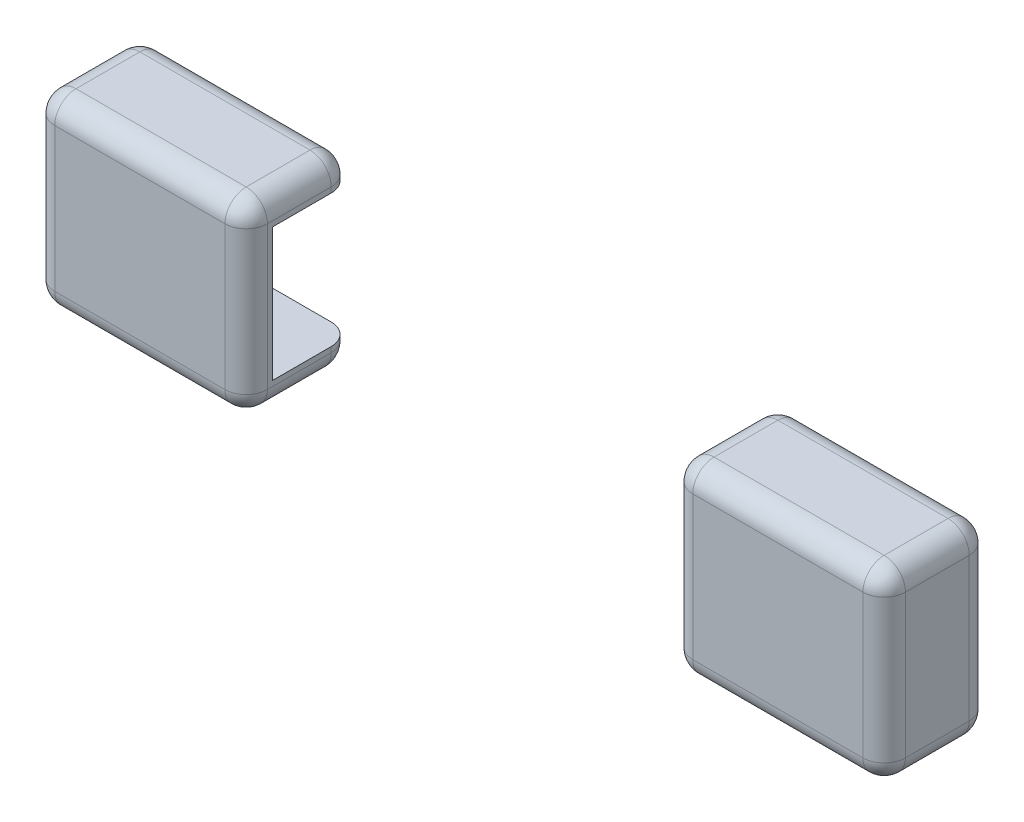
ISO-10303-21;
HEADER;
FILE_DESCRIPTION(('STEP AP214'),'2;1');
FILE_NAME('part.step','',(''),(''),'','','');
FILE_SCHEMA(('AUTOMOTIVE_DESIGN { 1 0 10303 214 1 1 1 1 }'));
ENDSEC;
DATA;
#1=APPLICATION_CONTEXT('core data for automotive mechanical design processes');
#2=APPLICATION_PROTOCOL_DEFINITION('international standard','automotive_design',2000,#1);
#3=PRODUCT_CONTEXT('',#1,'mechanical');
#4=PRODUCT('Part','Part','',(#3));
#5=PRODUCT_RELATED_PRODUCT_CATEGORY('part','',(#4));
#6=PRODUCT_DEFINITION_FORMATION('','',#4);
#7=PRODUCT_DEFINITION_CONTEXT('part definition',#1,'design');
#8=PRODUCT_DEFINITION('design','',#6,#7);
#9=PRODUCT_DEFINITION_SHAPE('','',#8);
#10=(LENGTH_UNIT() NAMED_UNIT(*) SI_UNIT(.MILLI.,.METRE.));
#11=(NAMED_UNIT(*) PLANE_ANGLE_UNIT() SI_UNIT($,.RADIAN.));
#12=(NAMED_UNIT(*) SI_UNIT($,.STERADIAN.) SOLID_ANGLE_UNIT());
#13=UNCERTAINTY_MEASURE_WITH_UNIT(LENGTH_MEASURE(1.E-05),#10,'distance_accuracy_value','');
#14=(GEOMETRIC_REPRESENTATION_CONTEXT(3) GLOBAL_UNCERTAINTY_ASSIGNED_CONTEXT((#13)) GLOBAL_UNIT_ASSIGNED_CONTEXT((#10,
#11,#12)) REPRESENTATION_CONTEXT('',''));
#15=CARTESIAN_POINT('',(0.,0.,0.));
#16=DIRECTION('',(0.,0.,1.));
#17=DIRECTION('',(1.,0.,0.));
#18=AXIS2_PLACEMENT_3D('',#15,#16,#17);
#19=CARTESIAN_POINT('',(-35.5,-2.5,-7.5));
#20=DIRECTION('',(0.,-1.,0.));
#21=DIRECTION('',(1.,0.,0.));
#22=AXIS2_PLACEMENT_3D('',#19,#20,#21);
#23=PLANE('',#22);
#24=DIRECTION('',(0.,0.,-1.));
#25=VECTOR('',#24,1.);
#26=CARTESIAN_POINT('',(-20.,-2.5,-7.5));
#27=LINE('',#26,#25);
#28=CARTESIAN_POINT('',(-20.,-2.5,0.));
#29=VERTEX_POINT('',#28);
#30=CARTESIAN_POINT('',(-20.,-2.5,-5.5));
#31=VERTEX_POINT('',#30);
#32=EDGE_CURVE('E195',#29,#31,#27,.T.);
#33=ORIENTED_EDGE('',*,*,#32,.T.);
#34=CARTESIAN_POINT('',(-22.,-2.5,-5.5));
#35=DIRECTION('',(0.,-1.,0.));
#36=DIRECTION('',(1.,0.,0.));
#37=AXIS2_PLACEMENT_3D('',#34,#35,#36);
#38=CIRCLE('',#37,2.);
#39=CARTESIAN_POINT('',(-22.,-2.5,-7.5));
#40=VERTEX_POINT('',#39);
#41=EDGE_CURVE('E49',#31,#40,#38,.F.);
#42=ORIENTED_EDGE('',*,*,#41,.T.);
#43=DIRECTION('',(1.,0.,0.));
#44=VECTOR('',#43,1.);
#45=CARTESIAN_POINT('',(-35.5,-2.5,-7.5));
#46=LINE('',#45,#44);
#47=CARTESIAN_POINT('',(-35.5,-2.5,-7.5));
#48=VERTEX_POINT('',#47);
#49=EDGE_CURVE('E227',#48,#40,#46,.T.);
#50=ORIENTED_EDGE('',*,*,#49,.F.);
#51=DIRECTION('',(0.,0.,1.));
#52=VECTOR('',#51,1.);
#53=CARTESIAN_POINT('',(-35.5,-2.5,-7.5));
#54=LINE('',#53,#52);
#55=CARTESIAN_POINT('',(-35.5,-2.5,0.));
#56=VERTEX_POINT('',#55);
#57=EDGE_CURVE('E206',#48,#56,#54,.T.);
#58=ORIENTED_EDGE('',*,*,#57,.T.);
#59=DIRECTION('',(-1.,0.,0.));
#60=VECTOR('',#59,1.);
#61=CARTESIAN_POINT('',(-35.5,-2.5,0.));
#62=LINE('',#61,#60);
#63=EDGE_CURVE('E211',#29,#56,#62,.T.);
#64=ORIENTED_EDGE('',*,*,#63,.F.);
#65=EDGE_LOOP('',(#33,#42,#50,#58,#64));
#66=FACE_BOUND('',#65,.T.);
#67=ADVANCED_FACE('F40',(#66),#23,.F.);
#68=CARTESIAN_POINT('',(35.5,10.,-7.5));
#69=DIRECTION('',(0.,1.,0.));
#70=DIRECTION('',(-1.,0.,0.));
#71=AXIS2_PLACEMENT_3D('',#68,#69,#70);
#72=PLANE('',#71);
#73=DIRECTION('',(-1.,0.,0.));
#74=VECTOR('',#73,1.);
#75=CARTESIAN_POINT('',(35.5,10.,-7.5));
#76=LINE('',#75,#74);
#77=CARTESIAN_POINT('',(-22.,10.,-7.5));
#78=VERTEX_POINT('',#77);
#79=CARTESIAN_POINT('',(-35.5,10.,-7.5));
#80=VERTEX_POINT('',#79);
#81=EDGE_CURVE('E224',#78,#80,#76,.T.);
#82=ORIENTED_EDGE('',*,*,#81,.F.);
#83=CARTESIAN_POINT('',(-22.,10.,-5.5));
#84=DIRECTION('',(0.,1.,0.));
#85=DIRECTION('',(-1.,0.,0.));
#86=AXIS2_PLACEMENT_3D('',#83,#84,#85);
#87=CIRCLE('',#86,2.);
#88=CARTESIAN_POINT('',(-20.,10.,-5.5));
#89=VERTEX_POINT('',#88);
#90=EDGE_CURVE('E12',#78,#89,#87,.F.);
#91=ORIENTED_EDGE('',*,*,#90,.T.);
#92=DIRECTION('',(0.,0.,1.));
#93=VECTOR('',#92,1.);
#94=CARTESIAN_POINT('',(-20.,10.,-7.5));
#95=LINE('',#94,#93);
#96=CARTESIAN_POINT('',(-20.,10.,0.));
#97=VERTEX_POINT('',#96);
#98=EDGE_CURVE('E363',#89,#97,#95,.T.);
#99=ORIENTED_EDGE('',*,*,#98,.T.);
#100=DIRECTION('',(1.,0.,0.));
#101=VECTOR('',#100,1.);
#102=CARTESIAN_POINT('',(35.5,10.,0.));
#103=LINE('',#102,#101);
#104=CARTESIAN_POINT('',(-35.5,10.,0.));
#105=VERTEX_POINT('',#104);
#106=EDGE_CURVE('E214',#105,#97,#103,.T.);
#107=ORIENTED_EDGE('',*,*,#106,.F.);
#108=DIRECTION('',(0.,0.,1.));
#109=VECTOR('',#108,1.);
#110=CARTESIAN_POINT('',(-35.5,10.,-7.5));
#111=LINE('',#110,#109);
#112=EDGE_CURVE('E231',#80,#105,#111,.T.);
#113=ORIENTED_EDGE('',*,*,#112,.F.);
#114=EDGE_LOOP('',(#82,#91,#99,#107,#113));
#115=FACE_BOUND('',#114,.T.);
#116=ADVANCED_FACE('F372',(#115),#72,.F.);
#117=CARTESIAN_POINT('',(-40.,12.5,84.391696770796));
#118=DIRECTION('',(0.,1.,0.));
#119=DIRECTION('',(-1.,0.,0.));
#120=AXIS2_PLACEMENT_3D('',#117,#118,#119);
#121=PLANE('',#120);
#122=DIRECTION('',(0.,0.,-1.));
#123=VECTOR('',#122,1.);
#124=CARTESIAN_POINT('',(-38.,12.5,84.391696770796));
#125=LINE('',#124,#123);
#126=CARTESIAN_POINT('',(-38.,12.5,-5.5));
#127=VERTEX_POINT('',#126);
#128=CARTESIAN_POINT('',(-38.,12.5,0.5));
#129=VERTEX_POINT('',#128);
#130=EDGE_CURVE('E258',#127,#129,#125,.F.);
#131=ORIENTED_EDGE('',*,*,#130,.T.);
#132=DIRECTION('',(1.,0.,0.));
#133=VECTOR('',#132,1.);
#134=CARTESIAN_POINT('',(-40.,12.5,0.5));
#135=LINE('',#134,#133);
#136=CARTESIAN_POINT('',(-22.,12.5,0.5));
#137=VERTEX_POINT('',#136);
#138=EDGE_CURVE('E262',#129,#137,#135,.T.);
#139=ORIENTED_EDGE('',*,*,#138,.T.);
#140=DIRECTION('',(0.,0.,1.));
#141=VECTOR('',#140,1.);
#142=CARTESIAN_POINT('',(-22.,12.5,-7.5));
#143=LINE('',#142,#141);
#144=CARTESIAN_POINT('',(-22.,12.5,-5.5));
#145=VERTEX_POINT('',#144);
#146=EDGE_CURVE('E260',#137,#145,#143,.F.);
#147=ORIENTED_EDGE('',*,*,#146,.T.);
#148=DIRECTION('',(1.,0.,0.));
#149=VECTOR('',#148,1.);
#150=CARTESIAN_POINT('',(-40.,12.5,-5.5));
#151=LINE('',#150,#149);
#152=EDGE_CURVE('E256',#145,#127,#151,.F.);
#153=ORIENTED_EDGE('',*,*,#152,.T.);
#154=EDGE_LOOP('',(#131,#139,#147,#153));
#155=FACE_BOUND('',#154,.T.);
#156=ADVANCED_FACE('F485',(#155),#121,.T.);
#157=CARTESIAN_POINT('',(-40.,-5.,84.391696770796));
#158=DIRECTION('',(0.,-1.,0.));
#159=DIRECTION('',(1.,0.,0.));
#160=AXIS2_PLACEMENT_3D('',#157,#158,#159);
#161=PLANE('',#160);
#162=DIRECTION('',(0.,0.,-1.));
#163=VECTOR('',#162,1.);
#164=CARTESIAN_POINT('',(-22.,-5.,2.5));
#165=LINE('',#164,#163);
#166=CARTESIAN_POINT('',(-22.,-5.,-5.5));
#167=VERTEX_POINT('',#166);
#168=CARTESIAN_POINT('',(-22.,-5.,0.5));
#169=VERTEX_POINT('',#168);
#170=EDGE_CURVE('E233',#167,#169,#165,.F.);
#171=ORIENTED_EDGE('',*,*,#170,.T.);
#172=DIRECTION('',(-1.,0.,0.));
#173=VECTOR('',#172,1.);
#174=CARTESIAN_POINT('',(-40.,-5.,0.5));
#175=LINE('',#174,#173);
#176=CARTESIAN_POINT('',(-38.,-5.,0.5));
#177=VERTEX_POINT('',#176);
#178=EDGE_CURVE('E235',#169,#177,#175,.T.);
#179=ORIENTED_EDGE('',*,*,#178,.T.);
#180=DIRECTION('',(0.,0.,-1.));
#181=VECTOR('',#180,1.);
#182=CARTESIAN_POINT('',(-38.,-5.,84.391696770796));
#183=LINE('',#182,#181);
#184=CARTESIAN_POINT('',(-38.,-5.,-5.5));
#185=VERTEX_POINT('',#184);
#186=EDGE_CURVE('E230',#177,#185,#183,.T.);
#187=ORIENTED_EDGE('',*,*,#186,.T.);
#188=DIRECTION('',(-1.,0.,0.));
#189=VECTOR('',#188,1.);
#190=CARTESIAN_POINT('',(-20.,-5.,-5.5));
#191=LINE('',#190,#189);
#192=EDGE_CURVE('E228',#185,#167,#191,.F.);
#193=ORIENTED_EDGE('',*,*,#192,.T.);
#194=EDGE_LOOP('',(#171,#179,#187,#193));
#195=FACE_BOUND('',#194,.T.);
#196=ADVANCED_FACE('F505',(#195),#161,.T.);
#197=CARTESIAN_POINT('',(35.5,8.,-7.5));
#198=DIRECTION('',(0.,0.,1.));
#199=DIRECTION('',(1.,0.,0.));
#200=AXIS2_PLACEMENT_3D('',#197,#198,#199);
#201=PLANE('',#200);
#202=ORIENTED_EDGE('',*,*,#49,.T.);
#203=DIRECTION('',(0.,-1.,0.));
#204=VECTOR('',#203,1.);
#205=CARTESIAN_POINT('',(-22.,7.99999999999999,-7.5));
#206=LINE('',#205,#204);
#207=CARTESIAN_POINT('',(-22.,-3.,-7.5));
#208=VERTEX_POINT('',#207);
#209=EDGE_CURVE('E57',#40,#208,#206,.T.);
#210=ORIENTED_EDGE('',*,*,#209,.T.);
#211=DIRECTION('',(-1.,0.,0.));
#212=VECTOR('',#211,1.);
#213=CARTESIAN_POINT('',(-40.,-3.,-7.5));
#214=LINE('',#213,#212);
#215=CARTESIAN_POINT('',(-38.,-3.,-7.5));
#216=VERTEX_POINT('',#215);
#217=EDGE_CURVE('E61',#208,#216,#214,.T.);
#218=ORIENTED_EDGE('',*,*,#217,.T.);
#219=DIRECTION('',(0.,1.,0.));
#220=VECTOR('',#219,1.);
#221=CARTESIAN_POINT('',(-38.,12.5,-7.5));
#222=LINE('',#221,#220);
#223=CARTESIAN_POINT('',(-38.,10.5,-7.5));
#224=VERTEX_POINT('',#223);
#225=EDGE_CURVE('E277',#216,#224,#222,.T.);
#226=ORIENTED_EDGE('',*,*,#225,.T.);
#227=DIRECTION('',(1.,0.,0.));
#228=VECTOR('',#227,1.);
#229=CARTESIAN_POINT('',(-20.,10.5,-7.5));
#230=LINE('',#229,#228);
#231=CARTESIAN_POINT('',(-22.,10.5,-7.5));
#232=VERTEX_POINT('',#231);
#233=EDGE_CURVE('E275',#224,#232,#230,.T.);
#234=ORIENTED_EDGE('',*,*,#233,.T.);
#235=DIRECTION('',(0.,-1.,0.));
#236=VECTOR('',#235,1.);
#237=CARTESIAN_POINT('',(-22.,7.99999999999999,-7.5));
#238=LINE('',#237,#236);
#239=EDGE_CURVE('E280',#232,#78,#238,.T.);
#240=ORIENTED_EDGE('',*,*,#239,.T.);
#241=ORIENTED_EDGE('',*,*,#81,.T.);
#242=CARTESIAN_POINT('',(-35.5,8.,-7.5));
#243=DIRECTION('',(0.,0.,1.));
#244=DIRECTION('',(1.,0.,0.));
#245=AXIS2_PLACEMENT_3D('',#242,#243,#244);
#246=CIRCLE('',#245,2.);
#247=CARTESIAN_POINT('',(-37.5,8.,-7.5));
#248=VERTEX_POINT('',#247);
#249=EDGE_CURVE('E375',#80,#248,#246,.T.);
#250=ORIENTED_EDGE('',*,*,#249,.T.);
#251=DIRECTION('',(0.,-1.,0.));
#252=VECTOR('',#251,1.);
#253=CARTESIAN_POINT('',(-37.5,8.,-7.5));
#254=LINE('',#253,#252);
#255=CARTESIAN_POINT('',(-37.5,6.,-7.5));
#256=VERTEX_POINT('',#255);
#257=EDGE_CURVE('E376',#248,#256,#254,.T.);
#258=ORIENTED_EDGE('',*,*,#257,.T.);
#259=DIRECTION('',(1.,0.,0.));
#260=VECTOR('',#259,1.);
#261=CARTESIAN_POINT('',(-37.5,6.,-7.5));
#262=LINE('',#261,#260);
#263=CARTESIAN_POINT('',(-37.25,6.,-7.5));
#264=VERTEX_POINT('',#263);
#265=EDGE_CURVE('E396',#256,#264,#262,.T.);
#266=ORIENTED_EDGE('',*,*,#265,.T.);
#267=DIRECTION('',(0.,-1.,0.));
#268=VECTOR('',#267,1.);
#269=CARTESIAN_POINT('',(-37.25,6.,-7.5));
#270=LINE('',#269,#268);
#271=CARTESIAN_POINT('',(-37.25,1.5,-7.5));
#272=VERTEX_POINT('',#271);
#273=EDGE_CURVE('E393',#264,#272,#270,.T.);
#274=ORIENTED_EDGE('',*,*,#273,.T.);
#275=DIRECTION('',(-1.,0.,0.));
#276=VECTOR('',#275,1.);
#277=CARTESIAN_POINT('',(-37.25,1.5,-7.5));
#278=LINE('',#277,#276);
#279=CARTESIAN_POINT('',(-37.5,1.5,-7.5));
#280=VERTEX_POINT('',#279);
#281=EDGE_CURVE('E387',#272,#280,#278,.T.);
#282=ORIENTED_EDGE('',*,*,#281,.T.);
#283=DIRECTION('',(0.,-1.,0.));
#284=VECTOR('',#283,1.);
#285=CARTESIAN_POINT('',(-37.5,1.5,-7.5));
#286=LINE('',#285,#284);
#287=CARTESIAN_POINT('',(-37.5,-0.5,-7.5));
#288=VERTEX_POINT('',#287);
#289=EDGE_CURVE('E383',#280,#288,#286,.T.);
#290=ORIENTED_EDGE('',*,*,#289,.T.);
#291=CARTESIAN_POINT('',(-35.5,-0.5,-7.5));
#292=DIRECTION('',(0.,0.,1.));
#293=DIRECTION('',(1.,0.,0.));
#294=AXIS2_PLACEMENT_3D('',#291,#292,#293);
#295=CIRCLE('',#294,2.);
#296=EDGE_CURVE('E381',#288,#48,#295,.T.);
#297=ORIENTED_EDGE('',*,*,#296,.T.);
#298=EDGE_LOOP('',(#202,#210,#218,#226,#234,#240,#241,#250,#258,#266,#274,#282,#290,#297));
#299=FACE_BOUND('',#298,.T.);
#300=ADVANCED_FACE('F368',(#299),#201,.F.);
#301=CARTESIAN_POINT('',(35.5,8.,2.5));
#302=DIRECTION('',(0.,0.,1.));
#303=DIRECTION('',(1.,0.,0.));
#304=AXIS2_PLACEMENT_3D('',#301,#302,#303);
#305=PLANE('',#304);
#306=DIRECTION('',(0.,1.,0.));
#307=VECTOR('',#306,1.);
#308=CARTESIAN_POINT('',(-38.,8.,2.5));
#309=LINE('',#308,#307);
#310=CARTESIAN_POINT('',(-38.,10.5,2.5));
#311=VERTEX_POINT('',#310);
#312=CARTESIAN_POINT('',(-38.,-3.,2.5));
#313=VERTEX_POINT('',#312);
#314=EDGE_CURVE('E242',#311,#313,#309,.F.);
#315=ORIENTED_EDGE('',*,*,#314,.T.);
#316=DIRECTION('',(-1.,0.,0.));
#317=VECTOR('',#316,1.);
#318=CARTESIAN_POINT('',(35.5,-3.00000000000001,2.5));
#319=LINE('',#318,#317);
#320=CARTESIAN_POINT('',(-22.,-3.,2.5));
#321=VERTEX_POINT('',#320);
#322=EDGE_CURVE('E244',#313,#321,#319,.F.);
#323=ORIENTED_EDGE('',*,*,#322,.T.);
#324=DIRECTION('',(0.,-1.,0.));
#325=VECTOR('',#324,1.);
#326=CARTESIAN_POINT('',(-22.,12.5,2.5));
#327=LINE('',#326,#325);
#328=CARTESIAN_POINT('',(-22.,10.5,2.5));
#329=VERTEX_POINT('',#328);
#330=EDGE_CURVE('E238',#321,#329,#327,.F.);
#331=ORIENTED_EDGE('',*,*,#330,.T.);
#332=DIRECTION('',(1.,0.,0.));
#333=VECTOR('',#332,1.);
#334=CARTESIAN_POINT('',(35.5,10.5,2.5));
#335=LINE('',#334,#333);
#336=EDGE_CURVE('E240',#329,#311,#335,.F.);
#337=ORIENTED_EDGE('',*,*,#336,.T.);
#338=EDGE_LOOP('',(#315,#323,#331,#337));
#339=FACE_BOUND('',#338,.T.);
#340=ADVANCED_FACE('F756',(#339),#305,.T.);
#341=CARTESIAN_POINT('',(-40.,12.5,0.));
#342=DIRECTION('',(0.,0.,1.));
#343=DIRECTION('',(1.,0.,0.));
#344=AXIS2_PLACEMENT_3D('',#341,#342,#343);
#345=PLANE('',#344);
#346=ORIENTED_EDGE('',*,*,#106,.T.);
#347=DIRECTION('',(0.,-1.,0.));
#348=VECTOR('',#347,1.);
#349=CARTESIAN_POINT('',(-20.,12.5,0.));
#350=LINE('',#349,#348);
#351=EDGE_CURVE('E199',#97,#29,#350,.T.);
#352=ORIENTED_EDGE('',*,*,#351,.T.);
#353=ORIENTED_EDGE('',*,*,#63,.T.);
#354=CARTESIAN_POINT('',(-35.5,-0.5,0.));
#355=DIRECTION('',(0.,0.,1.));
#356=DIRECTION('',(1.,0.,0.));
#357=AXIS2_PLACEMENT_3D('',#354,#355,#356);
#358=CIRCLE('',#357,2.);
#359=CARTESIAN_POINT('',(-37.5,-0.5,0.));
#360=VERTEX_POINT('',#359);
#361=EDGE_CURVE('E218',#56,#360,#358,.F.);
#362=ORIENTED_EDGE('',*,*,#361,.T.);
#363=DIRECTION('',(0.,1.,0.));
#364=VECTOR('',#363,1.);
#365=CARTESIAN_POINT('',(-37.5,1.5,0.));
#366=LINE('',#365,#364);
#367=CARTESIAN_POINT('',(-37.5,1.5,0.));
#368=VERTEX_POINT('',#367);
#369=EDGE_CURVE('E220',#360,#368,#366,.T.);
#370=ORIENTED_EDGE('',*,*,#369,.T.);
#371=DIRECTION('',(1.,0.,0.));
#372=VECTOR('',#371,1.);
#373=CARTESIAN_POINT('',(-37.25,1.5,0.));
#374=LINE('',#373,#372);
#375=CARTESIAN_POINT('',(-37.25,1.5,0.));
#376=VERTEX_POINT('',#375);
#377=EDGE_CURVE('E403',#368,#376,#374,.T.);
#378=ORIENTED_EDGE('',*,*,#377,.T.);
#379=DIRECTION('',(0.,1.,0.));
#380=VECTOR('',#379,1.);
#381=CARTESIAN_POINT('',(-37.25,6.,0.));
#382=LINE('',#381,#380);
#383=CARTESIAN_POINT('',(-37.25,6.,0.));
#384=VERTEX_POINT('',#383);
#385=EDGE_CURVE('E406',#376,#384,#382,.T.);
#386=ORIENTED_EDGE('',*,*,#385,.T.);
#387=DIRECTION('',(-1.,0.,0.));
#388=VECTOR('',#387,1.);
#389=CARTESIAN_POINT('',(-37.5,6.,0.));
#390=LINE('',#389,#388);
#391=CARTESIAN_POINT('',(-37.5,6.,0.));
#392=VERTEX_POINT('',#391);
#393=EDGE_CURVE('E409',#384,#392,#390,.T.);
#394=ORIENTED_EDGE('',*,*,#393,.T.);
#395=DIRECTION('',(0.,1.,0.));
#396=VECTOR('',#395,1.);
#397=CARTESIAN_POINT('',(-37.5,8.,0.));
#398=LINE('',#397,#396);
#399=CARTESIAN_POINT('',(-37.5,8.,0.));
#400=VERTEX_POINT('',#399);
#401=EDGE_CURVE('E412',#392,#400,#398,.T.);
#402=ORIENTED_EDGE('',*,*,#401,.T.);
#403=CARTESIAN_POINT('',(-35.5,8.,0.));
#404=DIRECTION('',(0.,0.,1.));
#405=DIRECTION('',(1.,0.,0.));
#406=AXIS2_PLACEMENT_3D('',#403,#404,#405);
#407=CIRCLE('',#406,2.);
#408=EDGE_CURVE('E414',#400,#105,#407,.F.);
#409=ORIENTED_EDGE('',*,*,#408,.T.);
#410=EDGE_LOOP('',(#346,#352,#353,#362,#370,#378,#386,#394,#402,#409));
#411=FACE_BOUND('',#410,.T.);
#412=ADVANCED_FACE('F209',(#411),#345,.F.);
#413=CARTESIAN_POINT('',(-35.5,-0.5,-7.5));
#414=DIRECTION('',(0.,0.,1.));
#415=DIRECTION('',(1.,0.,0.));
#416=AXIS2_PLACEMENT_3D('',#413,#414,#415);
#417=CYLINDRICAL_SURFACE('',#416,2.);
#418=ORIENTED_EDGE('',*,*,#361,.F.);
#419=ORIENTED_EDGE('',*,*,#57,.F.);
#420=ORIENTED_EDGE('',*,*,#296,.F.);
#421=DIRECTION('',(0.,0.,1.));
#422=VECTOR('',#421,1.);
#423=CARTESIAN_POINT('',(-37.5,-0.5,-7.5));
#424=LINE('',#423,#422);
#425=EDGE_CURVE('E415',#288,#360,#424,.T.);
#426=ORIENTED_EDGE('',*,*,#425,.T.);
#427=EDGE_LOOP('',(#418,#419,#420,#426));
#428=FACE_BOUND('',#427,.T.);
#429=ADVANCED_FACE('F451',(#428),#417,.F.);
#430=CARTESIAN_POINT('',(-37.5,1.5,-7.5));
#431=DIRECTION('',(-1.,0.,0.));
#432=DIRECTION('',(0.,0.,1.));
#433=AXIS2_PLACEMENT_3D('',#430,#431,#432);
#434=PLANE('',#433);
#435=ORIENTED_EDGE('',*,*,#369,.F.);
#436=ORIENTED_EDGE('',*,*,#425,.F.);
#437=ORIENTED_EDGE('',*,*,#289,.F.);
#438=DIRECTION('',(0.,0.,1.));
#439=VECTOR('',#438,1.);
#440=CARTESIAN_POINT('',(-37.5,1.5,-7.5));
#441=LINE('',#440,#439);
#442=EDGE_CURVE('E417',#280,#368,#441,.T.);
#443=ORIENTED_EDGE('',*,*,#442,.T.);
#444=EDGE_LOOP('',(#435,#436,#437,#443));
#445=FACE_BOUND('',#444,.T.);
#446=ADVANCED_FACE('F450',(#445),#434,.F.);
#447=CARTESIAN_POINT('',(-37.25,1.5,-7.5));
#448=DIRECTION('',(0.,1.,0.));
#449=DIRECTION('',(0.,0.,1.));
#450=AXIS2_PLACEMENT_3D('',#447,#448,#449);
#451=PLANE('',#450);
#452=ORIENTED_EDGE('',*,*,#377,.F.);
#453=ORIENTED_EDGE('',*,*,#442,.F.);
#454=ORIENTED_EDGE('',*,*,#281,.F.);
#455=DIRECTION('',(0.,0.,1.));
#456=VECTOR('',#455,1.);
#457=CARTESIAN_POINT('',(-37.25,1.5,-7.5));
#458=LINE('',#457,#456);
#459=EDGE_CURVE('E420',#272,#376,#458,.T.);
#460=ORIENTED_EDGE('',*,*,#459,.T.);
#461=EDGE_LOOP('',(#452,#453,#454,#460));
#462=FACE_BOUND('',#461,.T.);
#463=ADVANCED_FACE('F448',(#462),#451,.F.);
#464=CARTESIAN_POINT('',(-37.25,6.,-7.5));
#465=DIRECTION('',(-1.,0.,0.));
#466=DIRECTION('',(0.,0.,1.));
#467=AXIS2_PLACEMENT_3D('',#464,#465,#466);
#468=PLANE('',#467);
#469=ORIENTED_EDGE('',*,*,#385,.F.);
#470=ORIENTED_EDGE('',*,*,#459,.F.);
#471=ORIENTED_EDGE('',*,*,#273,.F.);
#472=DIRECTION('',(0.,0.,1.));
#473=VECTOR('',#472,1.);
#474=CARTESIAN_POINT('',(-37.25,6.,-7.5));
#475=LINE('',#474,#473);
#476=EDGE_CURVE('E425',#264,#384,#475,.T.);
#477=ORIENTED_EDGE('',*,*,#476,.T.);
#478=EDGE_LOOP('',(#469,#470,#471,#477));
#479=FACE_BOUND('',#478,.T.);
#480=ADVANCED_FACE('F444',(#479),#468,.F.);
#481=CARTESIAN_POINT('',(-37.5,6.,-7.5));
#482=DIRECTION('',(0.,-1.,0.));
#483=DIRECTION('',(0.,0.,-1.));
#484=AXIS2_PLACEMENT_3D('',#481,#482,#483);
#485=PLANE('',#484);
#486=ORIENTED_EDGE('',*,*,#393,.F.);
#487=ORIENTED_EDGE('',*,*,#476,.F.);
#488=ORIENTED_EDGE('',*,*,#265,.F.);
#489=DIRECTION('',(0.,0.,1.));
#490=VECTOR('',#489,1.);
#491=CARTESIAN_POINT('',(-37.5,6.,-7.5));
#492=LINE('',#491,#490);
#493=EDGE_CURVE('E428',#256,#392,#492,.T.);
#494=ORIENTED_EDGE('',*,*,#493,.T.);
#495=EDGE_LOOP('',(#486,#487,#488,#494));
#496=FACE_BOUND('',#495,.T.);
#497=ADVANCED_FACE('F441',(#496),#485,.F.);
#498=CARTESIAN_POINT('',(-37.5,8.,-7.5));
#499=DIRECTION('',(-1.,0.,0.));
#500=DIRECTION('',(0.,0.,1.));
#501=AXIS2_PLACEMENT_3D('',#498,#499,#500);
#502=PLANE('',#501);
#503=ORIENTED_EDGE('',*,*,#401,.F.);
#504=ORIENTED_EDGE('',*,*,#493,.F.);
#505=ORIENTED_EDGE('',*,*,#257,.F.);
#506=DIRECTION('',(0.,0.,1.));
#507=VECTOR('',#506,1.);
#508=CARTESIAN_POINT('',(-37.5,8.,-7.5));
#509=LINE('',#508,#507);
#510=EDGE_CURVE('E431',#248,#400,#509,.T.);
#511=ORIENTED_EDGE('',*,*,#510,.T.);
#512=EDGE_LOOP('',(#503,#504,#505,#511));
#513=FACE_BOUND('',#512,.T.);
#514=ADVANCED_FACE('F439',(#513),#502,.F.);
#515=CARTESIAN_POINT('',(-35.5,8.,-7.5));
#516=DIRECTION('',(0.,0.,1.));
#517=DIRECTION('',(1.,0.,0.));
#518=AXIS2_PLACEMENT_3D('',#515,#516,#517);
#519=CYLINDRICAL_SURFACE('',#518,2.);
#520=ORIENTED_EDGE('',*,*,#408,.F.);
#521=ORIENTED_EDGE('',*,*,#510,.F.);
#522=ORIENTED_EDGE('',*,*,#249,.F.);
#523=ORIENTED_EDGE('',*,*,#112,.T.);
#524=EDGE_LOOP('',(#520,#521,#522,#523));
#525=FACE_BOUND('',#524,.T.);
#526=ADVANCED_FACE('F435',(#525),#519,.F.);
#527=CARTESIAN_POINT('',(-40.,12.5,84.391696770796));
#528=DIRECTION('',(-1.,0.,0.));
#529=DIRECTION('',(0.,0.,1.));
#530=AXIS2_PLACEMENT_3D('',#527,#528,#529);
#531=PLANE('',#530);
#532=DIRECTION('',(0.,0.,-1.));
#533=VECTOR('',#532,1.);
#534=CARTESIAN_POINT('',(-40.,-3.,84.391696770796));
#535=LINE('',#534,#533);
#536=CARTESIAN_POINT('',(-40.,-3.,-5.5));
#537=VERTEX_POINT('',#536);
#538=CARTESIAN_POINT('',(-40.,-3.,0.5));
#539=VERTEX_POINT('',#538);
#540=EDGE_CURVE('E251',#537,#539,#535,.F.);
#541=ORIENTED_EDGE('',*,*,#540,.T.);
#542=DIRECTION('',(0.,1.,0.));
#543=VECTOR('',#542,1.);
#544=CARTESIAN_POINT('',(-40.,12.5,0.5));
#545=LINE('',#544,#543);
#546=CARTESIAN_POINT('',(-40.,10.5,0.5));
#547=VERTEX_POINT('',#546);
#548=EDGE_CURVE('E253',#539,#547,#545,.T.);
#549=ORIENTED_EDGE('',*,*,#548,.T.);
#550=DIRECTION('',(0.,0.,-1.));
#551=VECTOR('',#550,1.);
#552=CARTESIAN_POINT('',(-40.,10.5,84.391696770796));
#553=LINE('',#552,#551);
#554=CARTESIAN_POINT('',(-40.,10.5,-5.5));
#555=VERTEX_POINT('',#554);
#556=EDGE_CURVE('E249',#547,#555,#553,.T.);
#557=ORIENTED_EDGE('',*,*,#556,.T.);
#558=DIRECTION('',(0.,1.,0.));
#559=VECTOR('',#558,1.);
#560=CARTESIAN_POINT('',(-40.,-5.,-5.5));
#561=LINE('',#560,#559);
#562=EDGE_CURVE('E247',#555,#537,#561,.F.);
#563=ORIENTED_EDGE('',*,*,#562,.T.);
#564=EDGE_LOOP('',(#541,#549,#557,#563));
#565=FACE_BOUND('',#564,.T.);
#566=ADVANCED_FACE('F513',(#565),#531,.T.);
#567=CARTESIAN_POINT('',(-20.,22.0476031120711,-7.5));
#568=DIRECTION('',(-1.,0.,0.));
#569=DIRECTION('',(0.,-1.,0.));
#570=AXIS2_PLACEMENT_3D('',#567,#568,#569);
#571=PLANE('',#570);
#572=DIRECTION('',(0.,0.,-1.));
#573=VECTOR('',#572,1.);
#574=CARTESIAN_POINT('',(-20.,-3.00000000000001,-7.5));
#575=LINE('',#574,#573);
#576=CARTESIAN_POINT('',(-20.,-3.00000000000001,0.5));
#577=VERTEX_POINT('',#576);
#578=CARTESIAN_POINT('',(-20.,-3.00000000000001,-5.5));
#579=VERTEX_POINT('',#578);
#580=EDGE_CURVE('E272',#577,#579,#575,.T.);
#581=ORIENTED_EDGE('',*,*,#580,.T.);
#582=DIRECTION('',(0.,-1.,0.));
#583=VECTOR('',#582,1.);
#584=CARTESIAN_POINT('',(-20.,22.0476031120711,-5.5));
#585=LINE('',#584,#583);
#586=EDGE_CURVE('E202',#579,#31,#585,.F.);
#587=ORIENTED_EDGE('',*,*,#586,.T.);
#588=ORIENTED_EDGE('',*,*,#32,.F.);
#589=ORIENTED_EDGE('',*,*,#351,.F.);
#590=ORIENTED_EDGE('',*,*,#98,.F.);
#591=DIRECTION('',(0.,-1.,0.));
#592=VECTOR('',#591,1.);
#593=CARTESIAN_POINT('',(-20.,22.0476031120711,-5.5));
#594=LINE('',#593,#592);
#595=CARTESIAN_POINT('',(-20.,10.5,-5.5));
#596=VERTEX_POINT('',#595);
#597=EDGE_CURVE('E265',#89,#596,#594,.F.);
#598=ORIENTED_EDGE('',*,*,#597,.T.);
#599=DIRECTION('',(0.,0.,1.));
#600=VECTOR('',#599,1.);
#601=CARTESIAN_POINT('',(-20.,10.5,2.5));
#602=LINE('',#601,#600);
#603=CARTESIAN_POINT('',(-20.,10.5,0.5));
#604=VERTEX_POINT('',#603);
#605=EDGE_CURVE('E267',#596,#604,#602,.T.);
#606=ORIENTED_EDGE('',*,*,#605,.T.);
#607=DIRECTION('',(0.,-1.,0.));
#608=VECTOR('',#607,1.);
#609=CARTESIAN_POINT('',(-20.,-5.00000000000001,0.5));
#610=LINE('',#609,#608);
#611=EDGE_CURVE('E269',#604,#577,#610,.T.);
#612=ORIENTED_EDGE('',*,*,#611,.T.);
#613=EDGE_LOOP('',(#581,#587,#588,#589,#590,#598,#606,#612));
#614=FACE_BOUND('',#613,.T.);
#615=ADVANCED_FACE('F197',(#614),#571,.F.);
#616=CARTESIAN_POINT('',(-22.,7.99999999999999,-5.5));
#617=DIRECTION('',(0.,-1.,0.));
#618=DIRECTION('',(1.,0.,0.));
#619=AXIS2_PLACEMENT_3D('',#616,#617,#618);
#620=CYLINDRICAL_SURFACE('',#619,2.);
#621=ORIENTED_EDGE('',*,*,#90,.F.);
#622=ORIENTED_EDGE('',*,*,#239,.F.);
#623=CARTESIAN_POINT('',(-22.,10.5,-5.5));
#624=DIRECTION('',(0.,1.,0.));
#625=DIRECTION('',(0.,0.,1.));
#626=AXIS2_PLACEMENT_3D('',#623,#624,#625);
#627=CIRCLE('',#626,2.);
#628=EDGE_CURVE('E344',#596,#232,#627,.T.);
#629=ORIENTED_EDGE('',*,*,#628,.F.);
#630=ORIENTED_EDGE('',*,*,#597,.F.);
#631=EDGE_LOOP('',(#621,#622,#629,#630));
#632=FACE_BOUND('',#631,.T.);
#633=ADVANCED_FACE('F42',(#632),#620,.T.);
#634=CARTESIAN_POINT('',(35.5,10.5,-5.5));
#635=DIRECTION('',(-1.,0.,0.));
#636=DIRECTION('',(0.,-1.,0.));
#637=AXIS2_PLACEMENT_3D('',#634,#635,#636);
#638=CYLINDRICAL_SURFACE('',#637,2.);
#639=CARTESIAN_POINT('',(-22.,10.5,-5.5));
#640=DIRECTION('',(1.,0.,0.));
#641=DIRECTION('',(0.,0.,-1.));
#642=AXIS2_PLACEMENT_3D('',#639,#640,#641);
#643=CIRCLE('',#642,2.);
#644=EDGE_CURVE('E44',#232,#145,#643,.T.);
#645=ORIENTED_EDGE('',*,*,#644,.F.);
#646=ORIENTED_EDGE('',*,*,#233,.F.);
#647=CARTESIAN_POINT('',(-38.,10.5,-5.5));
#648=DIRECTION('',(-1.,0.,0.));
#649=DIRECTION('',(0.,0.,1.));
#650=AXIS2_PLACEMENT_3D('',#647,#648,#649);
#651=CIRCLE('',#650,2.);
#652=EDGE_CURVE('E342',#127,#224,#651,.T.);
#653=ORIENTED_EDGE('',*,*,#652,.F.);
#654=ORIENTED_EDGE('',*,*,#152,.F.);
#655=EDGE_LOOP('',(#645,#646,#653,#654));
#656=FACE_BOUND('',#655,.T.);
#657=ADVANCED_FACE('F474',(#656),#638,.T.);
#658=CARTESIAN_POINT('',(-22.,10.5,-5.5));
#659=DIRECTION('',(0.,0.,1.));
#660=DIRECTION('',(1.,0.,0.));
#661=AXIS2_PLACEMENT_3D('',#658,#659,#660);
#662=SPHERICAL_SURFACE('',#661,2.);
#663=ORIENTED_EDGE('',*,*,#628,.T.);
#664=ORIENTED_EDGE('',*,*,#644,.T.);
#665=CARTESIAN_POINT('',(-22.,10.5,-5.5));
#666=DIRECTION('',(0.,0.,-1.));
#667=DIRECTION('',(-1.,0.,0.));
#668=AXIS2_PLACEMENT_3D('',#665,#666,#667);
#669=CIRCLE('',#668,2.);
#670=EDGE_CURVE('E339',#596,#145,#669,.F.);
#671=ORIENTED_EDGE('',*,*,#670,.F.);
#672=EDGE_LOOP('',(#663,#664,#671));
#673=FACE_BOUND('',#672,.T.);
#674=ADVANCED_FACE('F351',(#673),#662,.T.);
#675=CARTESIAN_POINT('',(-38.,10.5,-5.5));
#676=DIRECTION('',(0.,0.,1.));
#677=DIRECTION('',(1.,0.,0.));
#678=AXIS2_PLACEMENT_3D('',#675,#676,#677);
#679=SPHERICAL_SURFACE('',#678,2.);
#680=CARTESIAN_POINT('',(-38.,10.5,-5.5));
#681=DIRECTION('',(0.,0.,-1.));
#682=DIRECTION('',(-1.,0.,0.));
#683=AXIS2_PLACEMENT_3D('',#680,#681,#682);
#684=CIRCLE('',#683,2.);
#685=EDGE_CURVE('E333',#127,#555,#684,.F.);
#686=ORIENTED_EDGE('',*,*,#685,.F.);
#687=ORIENTED_EDGE('',*,*,#652,.T.);
#688=CARTESIAN_POINT('',(-38.,10.5,-5.5));
#689=DIRECTION('',(0.,1.,0.));
#690=DIRECTION('',(-1.,0.,0.));
#691=AXIS2_PLACEMENT_3D('',#688,#689,#690);
#692=CIRCLE('',#691,2.);
#693=EDGE_CURVE('E336',#555,#224,#692,.F.);
#694=ORIENTED_EDGE('',*,*,#693,.F.);
#695=EDGE_LOOP('',(#686,#687,#694));
#696=FACE_BOUND('',#695,.T.);
#697=ADVANCED_FACE('F477',(#696),#679,.T.);
#698=CARTESIAN_POINT('',(-22.,10.5,-7.5));
#699=DIRECTION('',(0.,0.,-1.));
#700=DIRECTION('',(-1.,0.,0.));
#701=AXIS2_PLACEMENT_3D('',#698,#699,#700);
#702=CYLINDRICAL_SURFACE('',#701,2.);
#703=ORIENTED_EDGE('',*,*,#670,.T.);
#704=ORIENTED_EDGE('',*,*,#146,.F.);
#705=CARTESIAN_POINT('',(-22.,10.5,0.5));
#706=DIRECTION('',(0.,0.,1.));
#707=DIRECTION('',(1.,0.,0.));
#708=AXIS2_PLACEMENT_3D('',#705,#706,#707);
#709=CIRCLE('',#708,2.);
#710=EDGE_CURVE('E328',#604,#137,#709,.T.);
#711=ORIENTED_EDGE('',*,*,#710,.F.);
#712=ORIENTED_EDGE('',*,*,#605,.F.);
#713=EDGE_LOOP('',(#703,#704,#711,#712));
#714=FACE_BOUND('',#713,.T.);
#715=ADVANCED_FACE('F358',(#714),#702,.T.);
#716=CARTESIAN_POINT('',(-22.,7.99999999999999,-5.5));
#717=DIRECTION('',(0.,-1.,0.));
#718=DIRECTION('',(1.,0.,0.));
#719=AXIS2_PLACEMENT_3D('',#716,#717,#718);
#720=CYLINDRICAL_SURFACE('',#719,2.);
#721=ORIENTED_EDGE('',*,*,#41,.F.);
#722=ORIENTED_EDGE('',*,*,#586,.F.);
#723=CARTESIAN_POINT('',(-22.,-3.,-5.5));
#724=DIRECTION('',(0.,-1.,0.));
#725=DIRECTION('',(1.,0.,0.));
#726=AXIS2_PLACEMENT_3D('',#723,#724,#725);
#727=CIRCLE('',#726,2.);
#728=EDGE_CURVE('E325',#208,#579,#727,.T.);
#729=ORIENTED_EDGE('',*,*,#728,.F.);
#730=ORIENTED_EDGE('',*,*,#209,.F.);
#731=EDGE_LOOP('',(#721,#722,#729,#730));
#732=FACE_BOUND('',#731,.T.);
#733=ADVANCED_FACE('F453',(#732),#720,.T.);
#734=CARTESIAN_POINT('',(35.5,-3.00000000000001,-5.5));
#735=DIRECTION('',(1.,0.,0.));
#736=DIRECTION('',(0.,1.,0.));
#737=AXIS2_PLACEMENT_3D('',#734,#735,#736);
#738=CYLINDRICAL_SURFACE('',#737,2.);
#739=CARTESIAN_POINT('',(-38.,-3.,-5.5));
#740=DIRECTION('',(-1.,0.,0.));
#741=DIRECTION('',(0.,0.,1.));
#742=AXIS2_PLACEMENT_3D('',#739,#740,#741);
#743=CIRCLE('',#742,2.);
#744=EDGE_CURVE('E319',#216,#185,#743,.T.);
#745=ORIENTED_EDGE('',*,*,#744,.F.);
#746=ORIENTED_EDGE('',*,*,#217,.F.);
#747=CARTESIAN_POINT('',(-22.,-3.,-5.5));
#748=DIRECTION('',(1.,0.,0.));
#749=DIRECTION('',(0.,0.,-1.));
#750=AXIS2_PLACEMENT_3D('',#747,#748,#749);
#751=CIRCLE('',#750,2.);
#752=EDGE_CURVE('E322',#167,#208,#751,.T.);
#753=ORIENTED_EDGE('',*,*,#752,.F.);
#754=ORIENTED_EDGE('',*,*,#192,.F.);
#755=EDGE_LOOP('',(#745,#746,#753,#754));
#756=FACE_BOUND('',#755,.T.);
#757=ADVANCED_FACE('F463',(#756),#738,.T.);
#758=CARTESIAN_POINT('',(-38.,8.,-5.5));
#759=DIRECTION('',(0.,-1.,0.));
#760=DIRECTION('',(0.,0.,-1.));
#761=AXIS2_PLACEMENT_3D('',#758,#759,#760);
#762=CYLINDRICAL_SURFACE('',#761,2.);
#763=ORIENTED_EDGE('',*,*,#693,.T.);
#764=ORIENTED_EDGE('',*,*,#225,.F.);
#765=CARTESIAN_POINT('',(-38.,-3.,-5.5));
#766=DIRECTION('',(0.,-1.,0.));
#767=DIRECTION('',(0.,0.,-1.));
#768=AXIS2_PLACEMENT_3D('',#765,#766,#767);
#769=CIRCLE('',#768,2.);
#770=EDGE_CURVE('E316',#537,#216,#769,.T.);
#771=ORIENTED_EDGE('',*,*,#770,.F.);
#772=ORIENTED_EDGE('',*,*,#562,.F.);
#773=EDGE_LOOP('',(#763,#764,#771,#772));
#774=FACE_BOUND('',#773,.T.);
#775=ADVANCED_FACE('F471',(#774),#762,.T.);
#776=CARTESIAN_POINT('',(-38.,10.5,84.391696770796));
#777=DIRECTION('',(0.,0.,-1.));
#778=DIRECTION('',(-1.,0.,0.));
#779=AXIS2_PLACEMENT_3D('',#776,#777,#778);
#780=CYLINDRICAL_SURFACE('',#779,2.);
#781=ORIENTED_EDGE('',*,*,#685,.T.);
#782=ORIENTED_EDGE('',*,*,#556,.F.);
#783=CARTESIAN_POINT('',(-38.,10.5,0.5));
#784=DIRECTION('',(0.,0.,1.));
#785=DIRECTION('',(1.,0.,0.));
#786=AXIS2_PLACEMENT_3D('',#783,#784,#785);
#787=CIRCLE('',#786,2.);
#788=EDGE_CURVE('E313',#129,#547,#787,.T.);
#789=ORIENTED_EDGE('',*,*,#788,.F.);
#790=ORIENTED_EDGE('',*,*,#130,.F.);
#791=EDGE_LOOP('',(#781,#782,#789,#790));
#792=FACE_BOUND('',#791,.T.);
#793=ADVANCED_FACE('F482',(#792),#780,.T.);
#794=CARTESIAN_POINT('',(-40.,10.5,0.5));
#795=DIRECTION('',(1.,0.,0.));
#796=DIRECTION('',(0.,1.,0.));
#797=AXIS2_PLACEMENT_3D('',#794,#795,#796);
#798=CYLINDRICAL_SURFACE('',#797,2.);
#799=CARTESIAN_POINT('',(-22.,10.5,0.5));
#800=DIRECTION('',(1.,0.,0.));
#801=DIRECTION('',(0.,0.,-1.));
#802=AXIS2_PLACEMENT_3D('',#799,#800,#801);
#803=CIRCLE('',#802,2.);
#804=EDGE_CURVE('E330',#137,#329,#803,.T.);
#805=ORIENTED_EDGE('',*,*,#804,.F.);
#806=ORIENTED_EDGE('',*,*,#138,.F.);
#807=CARTESIAN_POINT('',(-38.,10.5,0.5));
#808=DIRECTION('',(-1.,0.,0.));
#809=DIRECTION('',(0.,0.,1.));
#810=AXIS2_PLACEMENT_3D('',#807,#808,#809);
#811=CIRCLE('',#810,2.);
#812=EDGE_CURVE('E310',#311,#129,#811,.T.);
#813=ORIENTED_EDGE('',*,*,#812,.F.);
#814=ORIENTED_EDGE('',*,*,#336,.F.);
#815=EDGE_LOOP('',(#805,#806,#813,#814));
#816=FACE_BOUND('',#815,.T.);
#817=ADVANCED_FACE('F489',(#816),#798,.T.);
#818=CARTESIAN_POINT('',(-22.,10.5,0.5));
#819=DIRECTION('',(0.,0.,1.));
#820=DIRECTION('',(1.,0.,0.));
#821=AXIS2_PLACEMENT_3D('',#818,#819,#820);
#822=SPHERICAL_SURFACE('',#821,2.);
#823=ORIENTED_EDGE('',*,*,#710,.T.);
#824=ORIENTED_EDGE('',*,*,#804,.T.);
#825=CARTESIAN_POINT('',(-22.,10.5,0.5));
#826=DIRECTION('',(0.,1.,0.));
#827=DIRECTION('',(0.,0.,1.));
#828=AXIS2_PLACEMENT_3D('',#825,#826,#827);
#829=CIRCLE('',#828,2.);
#830=EDGE_CURVE('E307',#604,#329,#829,.F.);
#831=ORIENTED_EDGE('',*,*,#830,.F.);
#832=EDGE_LOOP('',(#823,#824,#831));
#833=FACE_BOUND('',#832,.T.);
#834=ADVANCED_FACE('F493',(#833),#822,.T.);
#835=CARTESIAN_POINT('',(-22.,-3.,-5.5));
#836=DIRECTION('',(0.,0.,1.));
#837=DIRECTION('',(1.,0.,0.));
#838=AXIS2_PLACEMENT_3D('',#835,#836,#837);
#839=SPHERICAL_SURFACE('',#838,2.);
#840=ORIENTED_EDGE('',*,*,#752,.T.);
#841=ORIENTED_EDGE('',*,*,#728,.T.);
#842=CARTESIAN_POINT('',(-22.,-3.00000000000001,-5.5));
#843=DIRECTION('',(0.,0.,-1.));
#844=DIRECTION('',(-1.,0.,0.));
#845=AXIS2_PLACEMENT_3D('',#842,#843,#844);
#846=CIRCLE('',#845,2.);
#847=EDGE_CURVE('E304',#167,#579,#846,.F.);
#848=ORIENTED_EDGE('',*,*,#847,.F.);
#849=EDGE_LOOP('',(#840,#841,#848));
#850=FACE_BOUND('',#849,.T.);
#851=ADVANCED_FACE('F458',(#850),#839,.T.);
#852=CARTESIAN_POINT('',(-38.,-3.,-5.5));
#853=DIRECTION('',(0.,0.,1.));
#854=DIRECTION('',(1.,0.,0.));
#855=AXIS2_PLACEMENT_3D('',#852,#853,#854);
#856=SPHERICAL_SURFACE('',#855,2.);
#857=ORIENTED_EDGE('',*,*,#770,.T.);
#858=ORIENTED_EDGE('',*,*,#744,.T.);
#859=CARTESIAN_POINT('',(-38.,-3.,-5.5));
#860=DIRECTION('',(0.,0.,-1.));
#861=DIRECTION('',(-1.,0.,0.));
#862=AXIS2_PLACEMENT_3D('',#859,#860,#861);
#863=CIRCLE('',#862,2.);
#864=EDGE_CURVE('E301',#537,#185,#863,.F.);
#865=ORIENTED_EDGE('',*,*,#864,.F.);
#866=EDGE_LOOP('',(#857,#858,#865));
#867=FACE_BOUND('',#866,.T.);
#868=ADVANCED_FACE('F467',(#867),#856,.T.);
#869=CARTESIAN_POINT('',(-38.,10.5,0.5));
#870=DIRECTION('',(0.,0.,1.));
#871=DIRECTION('',(1.,0.,0.));
#872=AXIS2_PLACEMENT_3D('',#869,#870,#871);
#873=SPHERICAL_SURFACE('',#872,2.);
#874=ORIENTED_EDGE('',*,*,#812,.T.);
#875=ORIENTED_EDGE('',*,*,#788,.T.);
#876=CARTESIAN_POINT('',(-38.,10.5,0.5));
#877=DIRECTION('',(0.,1.,0.));
#878=DIRECTION('',(0.,0.,1.));
#879=AXIS2_PLACEMENT_3D('',#876,#877,#878);
#880=CIRCLE('',#879,2.);
#881=EDGE_CURVE('E299',#311,#547,#880,.F.);
#882=ORIENTED_EDGE('',*,*,#881,.F.);
#883=EDGE_LOOP('',(#874,#875,#882));
#884=FACE_BOUND('',#883,.T.);
#885=ADVANCED_FACE('F520',(#884),#873,.T.);
#886=CARTESIAN_POINT('',(-22.,22.0476031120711,0.5));
#887=DIRECTION('',(0.,1.,0.));
#888=DIRECTION('',(-1.,0.,0.));
#889=AXIS2_PLACEMENT_3D('',#886,#887,#888);
#890=CYLINDRICAL_SURFACE('',#889,2.);
#891=ORIENTED_EDGE('',*,*,#830,.T.);
#892=ORIENTED_EDGE('',*,*,#330,.F.);
#893=CARTESIAN_POINT('',(-22.,-3.00000000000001,0.5));
#894=DIRECTION('',(0.,-1.,0.));
#895=DIRECTION('',(0.,0.,-1.));
#896=AXIS2_PLACEMENT_3D('',#893,#894,#895);
#897=CIRCLE('',#896,2.);
#898=EDGE_CURVE('E296',#577,#321,#897,.T.);
#899=ORIENTED_EDGE('',*,*,#898,.F.);
#900=ORIENTED_EDGE('',*,*,#611,.F.);
#901=EDGE_LOOP('',(#891,#892,#899,#900));
#902=FACE_BOUND('',#901,.T.);
#903=ADVANCED_FACE('F496',(#902),#890,.T.);
#904=CARTESIAN_POINT('',(-22.,-3.00000000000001,-7.5));
#905=DIRECTION('',(0.,0.,1.));
#906=DIRECTION('',(1.,0.,0.));
#907=AXIS2_PLACEMENT_3D('',#904,#905,#906);
#908=CYLINDRICAL_SURFACE('',#907,2.);
#909=ORIENTED_EDGE('',*,*,#847,.T.);
#910=ORIENTED_EDGE('',*,*,#580,.F.);
#911=CARTESIAN_POINT('',(-22.,-3.,0.5));
#912=DIRECTION('',(0.,0.,1.));
#913=DIRECTION('',(1.,0.,0.));
#914=AXIS2_PLACEMENT_3D('',#911,#912,#913);
#915=CIRCLE('',#914,2.);
#916=EDGE_CURVE('E294',#169,#577,#915,.T.);
#917=ORIENTED_EDGE('',*,*,#916,.F.);
#918=ORIENTED_EDGE('',*,*,#170,.F.);
#919=EDGE_LOOP('',(#909,#910,#917,#918));
#920=FACE_BOUND('',#919,.T.);
#921=ADVANCED_FACE('F503',(#920),#908,.T.);
#922=CARTESIAN_POINT('',(-38.,-3.,84.391696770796));
#923=DIRECTION('',(0.,0.,-1.));
#924=DIRECTION('',(-1.,0.,0.));
#925=AXIS2_PLACEMENT_3D('',#922,#923,#924);
#926=CYLINDRICAL_SURFACE('',#925,2.);
#927=ORIENTED_EDGE('',*,*,#864,.T.);
#928=ORIENTED_EDGE('',*,*,#186,.F.);
#929=CARTESIAN_POINT('',(-38.,-3.,0.5));
#930=DIRECTION('',(0.,0.,1.));
#931=DIRECTION('',(1.,0.,0.));
#932=AXIS2_PLACEMENT_3D('',#929,#930,#931);
#933=CIRCLE('',#932,2.);
#934=EDGE_CURVE('E291',#539,#177,#933,.T.);
#935=ORIENTED_EDGE('',*,*,#934,.F.);
#936=ORIENTED_EDGE('',*,*,#540,.F.);
#937=EDGE_LOOP('',(#927,#928,#935,#936));
#938=FACE_BOUND('',#937,.T.);
#939=ADVANCED_FACE('F510',(#938),#926,.T.);
#940=CARTESIAN_POINT('',(-38.,12.5,0.5));
#941=DIRECTION('',(0.,1.,0.));
#942=DIRECTION('',(0.,0.,1.));
#943=AXIS2_PLACEMENT_3D('',#940,#941,#942);
#944=CYLINDRICAL_SURFACE('',#943,2.);
#945=ORIENTED_EDGE('',*,*,#881,.T.);
#946=ORIENTED_EDGE('',*,*,#548,.F.);
#947=CARTESIAN_POINT('',(-38.,-3.,0.5));
#948=DIRECTION('',(0.,-1.,0.));
#949=DIRECTION('',(0.,0.,-1.));
#950=AXIS2_PLACEMENT_3D('',#947,#948,#949);
#951=CIRCLE('',#950,2.);
#952=EDGE_CURVE('E288',#313,#539,#951,.T.);
#953=ORIENTED_EDGE('',*,*,#952,.F.);
#954=ORIENTED_EDGE('',*,*,#314,.F.);
#955=EDGE_LOOP('',(#945,#946,#953,#954));
#956=FACE_BOUND('',#955,.T.);
#957=ADVANCED_FACE('F516',(#956),#944,.T.);
#958=CARTESIAN_POINT('',(-22.,-3.,0.5));
#959=DIRECTION('',(0.,0.,1.));
#960=DIRECTION('',(1.,0.,0.));
#961=AXIS2_PLACEMENT_3D('',#958,#959,#960);
#962=SPHERICAL_SURFACE('',#961,2.);
#963=ORIENTED_EDGE('',*,*,#916,.T.);
#964=ORIENTED_EDGE('',*,*,#898,.T.);
#965=CARTESIAN_POINT('',(-22.,-3.,0.5));
#966=DIRECTION('',(1.,0.,0.));
#967=DIRECTION('',(0.,1.,0.));
#968=AXIS2_PLACEMENT_3D('',#965,#966,#967);
#969=CIRCLE('',#968,2.);
#970=EDGE_CURVE('E286',#169,#321,#969,.F.);
#971=ORIENTED_EDGE('',*,*,#970,.F.);
#972=EDGE_LOOP('',(#963,#964,#971));
#973=FACE_BOUND('',#972,.T.);
#974=ADVANCED_FACE('F544',(#973),#962,.T.);
#975=CARTESIAN_POINT('',(-38.,-3.,0.5));
#976=DIRECTION('',(0.,0.,1.));
#977=DIRECTION('',(1.,0.,0.));
#978=AXIS2_PLACEMENT_3D('',#975,#976,#977);
#979=SPHERICAL_SURFACE('',#978,2.);
#980=ORIENTED_EDGE('',*,*,#952,.T.);
#981=ORIENTED_EDGE('',*,*,#934,.T.);
#982=CARTESIAN_POINT('',(-38.,-3.,0.5));
#983=DIRECTION('',(-1.,0.,0.));
#984=DIRECTION('',(0.,0.,1.));
#985=AXIS2_PLACEMENT_3D('',#982,#983,#984);
#986=CIRCLE('',#985,2.);
#987=EDGE_CURVE('E284',#313,#177,#986,.F.);
#988=ORIENTED_EDGE('',*,*,#987,.F.);
#989=EDGE_LOOP('',(#980,#981,#988));
#990=FACE_BOUND('',#989,.T.);
#991=ADVANCED_FACE('F540',(#990),#979,.T.);
#992=CARTESIAN_POINT('',(-40.,-3.,0.5));
#993=DIRECTION('',(-1.,0.,0.));
#994=DIRECTION('',(0.,-1.,0.));
#995=AXIS2_PLACEMENT_3D('',#992,#993,#994);
#996=CYLINDRICAL_SURFACE('',#995,2.);
#997=ORIENTED_EDGE('',*,*,#970,.T.);
#998=ORIENTED_EDGE('',*,*,#322,.F.);
#999=ORIENTED_EDGE('',*,*,#987,.T.);
#1000=ORIENTED_EDGE('',*,*,#178,.F.);
#1001=EDGE_LOOP('',(#997,#998,#999,#1000));
#1002=FACE_BOUND('',#1001,.T.);
#1003=ADVANCED_FACE('F537',(#1002),#996,.T.);
#1004=CLOSED_SHELL('',(#67,#116,#156,#196,#300,#340,#412,#429,#446,#463,#480,#497,#514,#526,
#566,#615,#633,#657,#674,#697,#715,#733,#757,#775,#793,#817,#834,#851,#868,#885,#903,#921,#939,
#957,#974,#991,#1003));
#1005=MANIFOLD_SOLID_BREP('B2',#1004);
#1006=CARTESIAN_POINT('',(40.,12.5,84.391696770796));
#1007=DIRECTION('',(1.,0.,0.));
#1008=DIRECTION('',(0.,1.,0.));
#1009=AXIS2_PLACEMENT_3D('',#1006,#1007,#1008);
#1010=PLANE('',#1009);
#1011=DIRECTION('',(0.,0.,-1.));
#1012=VECTOR('',#1011,1.);
#1013=CARTESIAN_POINT('',(40.,10.5,84.391696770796));
#1014=LINE('',#1013,#1012);
#1015=CARTESIAN_POINT('',(40.,10.5,-5.5));
#1016=VERTEX_POINT('',#1015);
#1017=CARTESIAN_POINT('',(40.,10.5,0.5));
#1018=VERTEX_POINT('',#1017);
#1019=EDGE_CURVE('E1095',#1016,#1018,#1014,.F.);
#1020=ORIENTED_EDGE('',*,*,#1019,.T.);
#1021=DIRECTION('',(0.,-1.,0.));
#1022=VECTOR('',#1021,1.);
#1023=CARTESIAN_POINT('',(40.,12.5,0.5));
#1024=LINE('',#1023,#1022);
#1025=CARTESIAN_POINT('',(40.,-3.00000000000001,0.5));
#1026=VERTEX_POINT('',#1025);
#1027=EDGE_CURVE('E1099',#1018,#1026,#1024,.T.);
#1028=ORIENTED_EDGE('',*,*,#1027,.T.);
#1029=DIRECTION('',(0.,0.,-1.));
#1030=VECTOR('',#1029,1.);
#1031=CARTESIAN_POINT('',(40.,-3.00000000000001,84.391696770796));
#1032=LINE('',#1031,#1030);
#1033=CARTESIAN_POINT('',(40.,-3.00000000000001,-5.5));
#1034=VERTEX_POINT('',#1033);
#1035=EDGE_CURVE('E1097',#1026,#1034,#1032,.T.);
#1036=ORIENTED_EDGE('',*,*,#1035,.T.);
#1037=DIRECTION('',(0.,-1.,0.));
#1038=VECTOR('',#1037,1.);
#1039=CARTESIAN_POINT('',(40.,12.5,-5.5));
#1040=LINE('',#1039,#1038);
#1041=EDGE_CURVE('E1093',#1034,#1016,#1040,.F.);
#1042=ORIENTED_EDGE('',*,*,#1041,.T.);
#1043=EDGE_LOOP('',(#1020,#1028,#1036,#1042));
#1044=FACE_BOUND('',#1043,.T.);
#1045=ADVANCED_FACE('F834',(#1044),#1010,.T.);
#1046=CARTESIAN_POINT('',(35.5,-0.5,-7.5));
#1047=DIRECTION('',(0.,0.,1.));
#1048=DIRECTION('',(1.,0.,0.));
#1049=AXIS2_PLACEMENT_3D('',#1046,#1047,#1048);
#1050=CYLINDRICAL_SURFACE('',#1049,2.00000000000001);
#1051=CARTESIAN_POINT('',(35.5,-0.5,0.));
#1052=DIRECTION('',(0.,0.,1.));
#1053=DIRECTION('',(1.,0.,0.));
#1054=AXIS2_PLACEMENT_3D('',#1051,#1052,#1053);
#1055=CIRCLE('',#1054,2.00000000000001);
#1056=CARTESIAN_POINT('',(37.5,-0.5,0.));
#1057=VERTEX_POINT('',#1056);
#1058=CARTESIAN_POINT('',(35.5,-2.5,0.));
#1059=VERTEX_POINT('',#1058);
#1060=EDGE_CURVE('E1013',#1057,#1059,#1055,.F.);
#1061=ORIENTED_EDGE('',*,*,#1060,.F.);
#1062=DIRECTION('',(0.,0.,1.));
#1063=VECTOR('',#1062,1.);
#1064=CARTESIAN_POINT('',(37.5,-0.5,-7.5));
#1065=LINE('',#1064,#1063);
#1066=CARTESIAN_POINT('',(37.5,-0.5,-7.5));
#1067=VERTEX_POINT('',#1066);
#1068=EDGE_CURVE('E1056',#1067,#1057,#1065,.T.);
#1069=ORIENTED_EDGE('',*,*,#1068,.F.);
#1070=CARTESIAN_POINT('',(35.5,-0.5,-7.5));
#1071=DIRECTION('',(0.,0.,1.));
#1072=DIRECTION('',(1.,0.,0.));
#1073=AXIS2_PLACEMENT_3D('',#1070,#1071,#1072);
#1074=CIRCLE('',#1073,2.00000000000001);
#1075=CARTESIAN_POINT('',(35.5,-2.5,-7.5));
#1076=VERTEX_POINT('',#1075);
#1077=EDGE_CURVE('E1046',#1076,#1067,#1074,.T.);
#1078=ORIENTED_EDGE('',*,*,#1077,.F.);
#1079=DIRECTION('',(0.,0.,1.));
#1080=VECTOR('',#1079,1.);
#1081=CARTESIAN_POINT('',(35.5,-2.5,-7.5));
#1082=LINE('',#1081,#1080);
#1083=EDGE_CURVE('E1059',#1076,#1059,#1082,.T.);
#1084=ORIENTED_EDGE('',*,*,#1083,.T.);
#1085=EDGE_LOOP('',(#1061,#1069,#1078,#1084));
#1086=FACE_BOUND('',#1085,.T.);
#1087=ADVANCED_FACE('F1233',(#1086),#1050,.F.);
#1088=CARTESIAN_POINT('',(37.5,-0.5,-7.5));
#1089=DIRECTION('',(1.,0.,0.));
#1090=DIRECTION('',(0.,0.,-1.));
#1091=AXIS2_PLACEMENT_3D('',#1088,#1089,#1090);
#1092=PLANE('',#1091);
#1093=DIRECTION('',(0.,-1.,0.));
#1094=VECTOR('',#1093,1.);
#1095=CARTESIAN_POINT('',(37.5,-0.5,0.));
#1096=LINE('',#1095,#1094);
#1097=CARTESIAN_POINT('',(37.5,1.5,0.));
#1098=VERTEX_POINT('',#1097);
#1099=EDGE_CURVE('E1016',#1098,#1057,#1096,.T.);
#1100=ORIENTED_EDGE('',*,*,#1099,.F.);
#1101=DIRECTION('',(0.,0.,1.));
#1102=VECTOR('',#1101,1.);
#1103=CARTESIAN_POINT('',(37.5,1.5,-7.5));
#1104=LINE('',#1103,#1102);
#1105=CARTESIAN_POINT('',(37.5,1.5,-7.5));
#1106=VERTEX_POINT('',#1105);
#1107=EDGE_CURVE('E1053',#1106,#1098,#1104,.T.);
#1108=ORIENTED_EDGE('',*,*,#1107,.F.);
#1109=DIRECTION('',(0.,1.,0.));
#1110=VECTOR('',#1109,1.);
#1111=CARTESIAN_POINT('',(37.5,-0.5,-7.5));
#1112=LINE('',#1111,#1110);
#1113=EDGE_CURVE('E1049',#1067,#1106,#1112,.T.);
#1114=ORIENTED_EDGE('',*,*,#1113,.F.);
#1115=ORIENTED_EDGE('',*,*,#1068,.T.);
#1116=EDGE_LOOP('',(#1100,#1108,#1114,#1115));
#1117=FACE_BOUND('',#1116,.T.);
#1118=ADVANCED_FACE('F1230',(#1117),#1092,.F.);
#1119=CARTESIAN_POINT('',(37.5,1.5,-7.5));
#1120=DIRECTION('',(0.,1.,0.));
#1121=DIRECTION('',(0.,0.,1.));
#1122=AXIS2_PLACEMENT_3D('',#1119,#1120,#1121);
#1123=PLANE('',#1122);
#1124=DIRECTION('',(1.,0.,0.));
#1125=VECTOR('',#1124,1.);
#1126=CARTESIAN_POINT('',(37.5,1.5,0.));
#1127=LINE('',#1126,#1125);
#1128=CARTESIAN_POINT('',(37.25,1.5,0.));
#1129=VERTEX_POINT('',#1128);
#1130=EDGE_CURVE('E1023',#1129,#1098,#1127,.T.);
#1131=ORIENTED_EDGE('',*,*,#1130,.F.);
#1132=DIRECTION('',(0.,0.,1.));
#1133=VECTOR('',#1132,1.);
#1134=CARTESIAN_POINT('',(37.25,1.5,-7.5));
#1135=LINE('',#1134,#1133);
#1136=CARTESIAN_POINT('',(37.25,1.5,-7.5));
#1137=VERTEX_POINT('',#1136);
#1138=EDGE_CURVE('E1052',#1137,#1129,#1135,.T.);
#1139=ORIENTED_EDGE('',*,*,#1138,.F.);
#1140=DIRECTION('',(-1.,0.,0.));
#1141=VECTOR('',#1140,1.);
#1142=CARTESIAN_POINT('',(37.5,1.5,-7.5));
#1143=LINE('',#1142,#1141);
#1144=EDGE_CURVE('E1026',#1106,#1137,#1143,.T.);
#1145=ORIENTED_EDGE('',*,*,#1144,.F.);
#1146=ORIENTED_EDGE('',*,*,#1107,.T.);
#1147=EDGE_LOOP('',(#1131,#1139,#1145,#1146));
#1148=FACE_BOUND('',#1147,.T.);
#1149=ADVANCED_FACE('F1227',(#1148),#1123,.F.);
#1150=CARTESIAN_POINT('',(37.25,1.5,-7.5));
#1151=DIRECTION('',(1.,0.,0.));
#1152=DIRECTION('',(0.,0.,-1.));
#1153=AXIS2_PLACEMENT_3D('',#1150,#1151,#1152);
#1154=PLANE('',#1153);
#1155=DIRECTION('',(0.,-1.,0.));
#1156=VECTOR('',#1155,1.);
#1157=CARTESIAN_POINT('',(37.25,1.5,0.));
#1158=LINE('',#1157,#1156);
#1159=CARTESIAN_POINT('',(37.25,6.,0.));
#1160=VERTEX_POINT('',#1159);
#1161=EDGE_CURVE('E1008',#1160,#1129,#1158,.T.);
#1162=ORIENTED_EDGE('',*,*,#1161,.F.);
#1163=DIRECTION('',(0.,0.,1.));
#1164=VECTOR('',#1163,1.);
#1165=CARTESIAN_POINT('',(37.25,6.,-7.5));
#1166=LINE('',#1165,#1164);
#1167=CARTESIAN_POINT('',(37.25,6.,-7.5));
#1168=VERTEX_POINT('',#1167);
#1169=EDGE_CURVE('E1070',#1168,#1160,#1166,.T.);
#1170=ORIENTED_EDGE('',*,*,#1169,.F.);
#1171=DIRECTION('',(0.,1.,0.));
#1172=VECTOR('',#1171,1.);
#1173=CARTESIAN_POINT('',(37.25,1.5,-7.5));
#1174=LINE('',#1173,#1172);
#1175=EDGE_CURVE('E1029',#1137,#1168,#1174,.T.);
#1176=ORIENTED_EDGE('',*,*,#1175,.F.);
#1177=ORIENTED_EDGE('',*,*,#1138,.T.);
#1178=EDGE_LOOP('',(#1162,#1170,#1176,#1177));
#1179=FACE_BOUND('',#1178,.T.);
#1180=ADVANCED_FACE('F1223',(#1179),#1154,.F.);
#1181=CARTESIAN_POINT('',(37.25,6.,-7.5));
#1182=DIRECTION('',(0.,-1.,0.));
#1183=DIRECTION('',(0.,0.,-1.));
#1184=AXIS2_PLACEMENT_3D('',#1181,#1182,#1183);
#1185=PLANE('',#1184);
#1186=DIRECTION('',(-1.,0.,0.));
#1187=VECTOR('',#1186,1.);
#1188=CARTESIAN_POINT('',(37.25,6.,0.));
#1189=LINE('',#1188,#1187);
#1190=CARTESIAN_POINT('',(37.5,6.,0.));
#1191=VERTEX_POINT('',#1190);
#1192=EDGE_CURVE('E998',#1191,#1160,#1189,.T.);
#1193=ORIENTED_EDGE('',*,*,#1192,.F.);
#1194=DIRECTION('',(0.,0.,1.));
#1195=VECTOR('',#1194,1.);
#1196=CARTESIAN_POINT('',(37.5,6.,-7.5));
#1197=LINE('',#1196,#1195);
#1198=CARTESIAN_POINT('',(37.5,6.,-7.5));
#1199=VERTEX_POINT('',#1198);
#1200=EDGE_CURVE('E1067',#1199,#1191,#1197,.T.);
#1201=ORIENTED_EDGE('',*,*,#1200,.F.);
#1202=DIRECTION('',(1.,0.,0.));
#1203=VECTOR('',#1202,1.);
#1204=CARTESIAN_POINT('',(37.25,6.,-7.5));
#1205=LINE('',#1204,#1203);
#1206=EDGE_CURVE('E1032',#1168,#1199,#1205,.T.);
#1207=ORIENTED_EDGE('',*,*,#1206,.F.);
#1208=ORIENTED_EDGE('',*,*,#1169,.T.);
#1209=EDGE_LOOP('',(#1193,#1201,#1207,#1208));
#1210=FACE_BOUND('',#1209,.T.);
#1211=ADVANCED_FACE('F1219',(#1210),#1185,.F.);
#1212=CARTESIAN_POINT('',(37.5,6.,-7.5));
#1213=DIRECTION('',(1.,0.,0.));
#1214=DIRECTION('',(0.,1.,0.));
#1215=AXIS2_PLACEMENT_3D('',#1212,#1213,#1214);
#1216=PLANE('',#1215);
#1217=DIRECTION('',(0.,-1.,0.));
#1218=VECTOR('',#1217,1.);
#1219=CARTESIAN_POINT('',(37.5,6.,0.));
#1220=LINE('',#1219,#1218);
#1221=CARTESIAN_POINT('',(37.5,8.,0.));
#1222=VERTEX_POINT('',#1221);
#1223=EDGE_CURVE('E1204',#1222,#1191,#1220,.T.);
#1224=ORIENTED_EDGE('',*,*,#1223,.F.);
#1225=DIRECTION('',(0.,0.,1.));
#1226=VECTOR('',#1225,1.);
#1227=CARTESIAN_POINT('',(37.5,8.,-7.5));
#1228=LINE('',#1227,#1226);
#1229=CARTESIAN_POINT('',(37.5,8.,-7.5));
#1230=VERTEX_POINT('',#1229);
#1231=EDGE_CURVE('E1064',#1230,#1222,#1228,.T.);
#1232=ORIENTED_EDGE('',*,*,#1231,.F.);
#1233=DIRECTION('',(0.,1.,0.));
#1234=VECTOR('',#1233,1.);
#1235=CARTESIAN_POINT('',(37.5,6.,-7.5));
#1236=LINE('',#1235,#1234);
#1237=EDGE_CURVE('E1035',#1199,#1230,#1236,.T.);
#1238=ORIENTED_EDGE('',*,*,#1237,.F.);
#1239=ORIENTED_EDGE('',*,*,#1200,.T.);
#1240=EDGE_LOOP('',(#1224,#1232,#1238,#1239));
#1241=FACE_BOUND('',#1240,.T.);
#1242=ADVANCED_FACE('F1217',(#1241),#1216,.F.);
#1243=CARTESIAN_POINT('',(35.5,8.,-7.5));
#1244=DIRECTION('',(0.,0.,1.));
#1245=DIRECTION('',(1.,0.,0.));
#1246=AXIS2_PLACEMENT_3D('',#1243,#1244,#1245);
#1247=CYLINDRICAL_SURFACE('',#1246,2.);
#1248=CARTESIAN_POINT('',(35.5,8.,0.));
#1249=DIRECTION('',(0.,0.,1.));
#1250=DIRECTION('',(1.,0.,0.));
#1251=AXIS2_PLACEMENT_3D('',#1248,#1249,#1250);
#1252=CIRCLE('',#1251,2.);
#1253=CARTESIAN_POINT('',(35.5,10.,0.));
#1254=VERTEX_POINT('',#1253);
#1255=EDGE_CURVE('E1018',#1254,#1222,#1252,.F.);
#1256=ORIENTED_EDGE('',*,*,#1255,.F.);
#1257=DIRECTION('',(0.,0.,1.));
#1258=VECTOR('',#1257,1.);
#1259=CARTESIAN_POINT('',(35.5,10.,-7.5));
#1260=LINE('',#1259,#1258);
#1261=CARTESIAN_POINT('',(35.5,10.,-7.5));
#1262=VERTEX_POINT('',#1261);
#1263=EDGE_CURVE('E1061',#1262,#1254,#1260,.T.);
#1264=ORIENTED_EDGE('',*,*,#1263,.F.);
#1265=CARTESIAN_POINT('',(35.5,8.,-7.5));
#1266=DIRECTION('',(0.,0.,1.));
#1267=DIRECTION('',(1.,0.,0.));
#1268=AXIS2_PLACEMENT_3D('',#1265,#1266,#1267);
#1269=CIRCLE('',#1268,2.);
#1270=EDGE_CURVE('E1038',#1230,#1262,#1269,.T.);
#1271=ORIENTED_EDGE('',*,*,#1270,.F.);
#1272=ORIENTED_EDGE('',*,*,#1231,.T.);
#1273=EDGE_LOOP('',(#1256,#1264,#1271,#1272));
#1274=FACE_BOUND('',#1273,.T.);
#1275=ADVANCED_FACE('F1209',(#1274),#1247,.F.);
#1276=CARTESIAN_POINT('',(35.5,8.,2.5));
#1277=DIRECTION('',(0.,0.,1.));
#1278=DIRECTION('',(1.,0.,0.));
#1279=AXIS2_PLACEMENT_3D('',#1276,#1277,#1278);
#1280=PLANE('',#1279);
#1281=DIRECTION('',(0.,-1.,0.));
#1282=VECTOR('',#1281,1.);
#1283=CARTESIAN_POINT('',(38.,8.,2.5));
#1284=LINE('',#1283,#1282);
#1285=CARTESIAN_POINT('',(38.,-3.00000000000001,2.5));
#1286=VERTEX_POINT('',#1285);
#1287=CARTESIAN_POINT('',(38.,10.5,2.5));
#1288=VERTEX_POINT('',#1287);
#1289=EDGE_CURVE('E1088',#1286,#1288,#1284,.F.);
#1290=ORIENTED_EDGE('',*,*,#1289,.T.);
#1291=DIRECTION('',(1.,0.,0.));
#1292=VECTOR('',#1291,1.);
#1293=CARTESIAN_POINT('',(35.5,10.5,2.5));
#1294=LINE('',#1293,#1292);
#1295=CARTESIAN_POINT('',(22.,10.5,2.5));
#1296=VERTEX_POINT('',#1295);
#1297=EDGE_CURVE('E1090',#1288,#1296,#1294,.F.);
#1298=ORIENTED_EDGE('',*,*,#1297,.T.);
#1299=DIRECTION('',(0.,1.,0.));
#1300=VECTOR('',#1299,1.);
#1301=CARTESIAN_POINT('',(22.,-5.00000000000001,2.5));
#1302=LINE('',#1301,#1300);
#1303=CARTESIAN_POINT('',(22.,-3.00000000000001,2.5));
#1304=VERTEX_POINT('',#1303);
#1305=EDGE_CURVE('E1084',#1296,#1304,#1302,.F.);
#1306=ORIENTED_EDGE('',*,*,#1305,.T.);
#1307=DIRECTION('',(-1.,0.,0.));
#1308=VECTOR('',#1307,1.);
#1309=CARTESIAN_POINT('',(35.5,-3.00000000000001,2.5));
#1310=LINE('',#1309,#1308);
#1311=EDGE_CURVE('E1086',#1304,#1286,#1310,.F.);
#1312=ORIENTED_EDGE('',*,*,#1311,.T.);
#1313=EDGE_LOOP('',(#1290,#1298,#1306,#1312));
#1314=FACE_BOUND('',#1313,.T.);
#1315=ADVANCED_FACE('F1304',(#1314),#1280,.T.);
#1316=CARTESIAN_POINT('',(35.5,8.,-7.5));
#1317=DIRECTION('',(0.,0.,1.));
#1318=DIRECTION('',(1.,0.,0.));
#1319=AXIS2_PLACEMENT_3D('',#1316,#1317,#1318);
#1320=PLANE('',#1319);
#1321=DIRECTION('',(-1.,0.,0.));
#1322=VECTOR('',#1321,1.);
#1323=CARTESIAN_POINT('',(20.,-3.00000000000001,-7.5));
#1324=LINE('',#1323,#1322);
#1325=CARTESIAN_POINT('',(38.,-3.00000000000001,-7.5));
#1326=VERTEX_POINT('',#1325);
#1327=CARTESIAN_POINT('',(22.,-3.00000000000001,-7.5));
#1328=VERTEX_POINT('',#1327);
#1329=EDGE_CURVE('E851',#1326,#1328,#1324,.T.);
#1330=ORIENTED_EDGE('',*,*,#1329,.T.);
#1331=DIRECTION('',(0.,1.,0.));
#1332=VECTOR('',#1331,1.);
#1333=CARTESIAN_POINT('',(22.,8.,-7.5));
#1334=LINE('',#1333,#1332);
#1335=CARTESIAN_POINT('',(22.,-2.5,-7.5));
#1336=VERTEX_POINT('',#1335);
#1337=EDGE_CURVE('E1128',#1328,#1336,#1334,.T.);
#1338=ORIENTED_EDGE('',*,*,#1337,.T.);
#1339=DIRECTION('',(1.,0.,0.));
#1340=VECTOR('',#1339,1.);
#1341=CARTESIAN_POINT('',(-35.5,-2.5,-7.5));
#1342=LINE('',#1341,#1340);
#1343=EDGE_CURVE('E1044',#1336,#1076,#1342,.T.);
#1344=ORIENTED_EDGE('',*,*,#1343,.T.);
#1345=ORIENTED_EDGE('',*,*,#1077,.T.);
#1346=ORIENTED_EDGE('',*,*,#1113,.T.);
#1347=ORIENTED_EDGE('',*,*,#1144,.T.);
#1348=ORIENTED_EDGE('',*,*,#1175,.T.);
#1349=ORIENTED_EDGE('',*,*,#1206,.T.);
#1350=ORIENTED_EDGE('',*,*,#1237,.T.);
#1351=ORIENTED_EDGE('',*,*,#1270,.T.);
#1352=DIRECTION('',(-1.,0.,0.));
#1353=VECTOR('',#1352,1.);
#1354=CARTESIAN_POINT('',(35.5,10.,-7.5));
#1355=LINE('',#1354,#1353);
#1356=CARTESIAN_POINT('',(22.,10.,-7.5));
#1357=VERTEX_POINT('',#1356);
#1358=EDGE_CURVE('E1041',#1262,#1357,#1355,.T.);
#1359=ORIENTED_EDGE('',*,*,#1358,.T.);
#1360=DIRECTION('',(0.,1.,0.));
#1361=VECTOR('',#1360,1.);
#1362=CARTESIAN_POINT('',(22.,8.,-7.5));
#1363=LINE('',#1362,#1361);
#1364=CARTESIAN_POINT('',(22.,10.5,-7.5));
#1365=VERTEX_POINT('',#1364);
#1366=EDGE_CURVE('E1125',#1357,#1365,#1363,.T.);
#1367=ORIENTED_EDGE('',*,*,#1366,.T.);
#1368=DIRECTION('',(1.,0.,0.));
#1369=VECTOR('',#1368,1.);
#1370=CARTESIAN_POINT('',(40.,10.5,-7.5));
#1371=LINE('',#1370,#1369);
#1372=CARTESIAN_POINT('',(38.,10.5,-7.5));
#1373=VERTEX_POINT('',#1372);
#1374=EDGE_CURVE('E1122',#1365,#1373,#1371,.T.);
#1375=ORIENTED_EDGE('',*,*,#1374,.T.);
#1376=DIRECTION('',(0.,-1.,0.));
#1377=VECTOR('',#1376,1.);
#1378=CARTESIAN_POINT('',(38.,-5.00000000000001,-7.5));
#1379=LINE('',#1378,#1377);
#1380=EDGE_CURVE('E856',#1373,#1326,#1379,.T.);
#1381=ORIENTED_EDGE('',*,*,#1380,.T.);
#1382=EDGE_LOOP('',(#1330,#1338,#1344,#1345,#1346,#1347,#1348,#1349,#1350,#1351,#1359,#1367,
#1375,#1381));
#1383=FACE_BOUND('',#1382,.T.);
#1384=ADVANCED_FACE('F1214',(#1383),#1320,.F.);
#1385=CARTESIAN_POINT('',(-40.,-5.,84.391696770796));
#1386=DIRECTION('',(0.,-1.,0.));
#1387=DIRECTION('',(1.,0.,0.));
#1388=AXIS2_PLACEMENT_3D('',#1385,#1386,#1387);
#1389=PLANE('',#1388);
#1390=DIRECTION('',(0.,0.,-1.));
#1391=VECTOR('',#1390,1.);
#1392=CARTESIAN_POINT('',(38.,-5.00000000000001,84.391696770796));
#1393=LINE('',#1392,#1391);
#1394=CARTESIAN_POINT('',(38.,-5.00000000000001,-5.5));
#1395=VERTEX_POINT('',#1394);
#1396=CARTESIAN_POINT('',(38.,-5.00000000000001,0.5));
#1397=VERTEX_POINT('',#1396);
#1398=EDGE_CURVE('E1106',#1395,#1397,#1393,.F.);
#1399=ORIENTED_EDGE('',*,*,#1398,.T.);
#1400=DIRECTION('',(-1.,0.,0.));
#1401=VECTOR('',#1400,1.);
#1402=CARTESIAN_POINT('',(-40.,-5.,0.5));
#1403=LINE('',#1402,#1401);
#1404=CARTESIAN_POINT('',(22.,-5.00000000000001,0.5));
#1405=VERTEX_POINT('',#1404);
#1406=EDGE_CURVE('E1108',#1397,#1405,#1403,.T.);
#1407=ORIENTED_EDGE('',*,*,#1406,.T.);
#1408=DIRECTION('',(0.,0.,1.));
#1409=VECTOR('',#1408,1.);
#1410=CARTESIAN_POINT('',(22.,-5.00000000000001,-7.5));
#1411=LINE('',#1410,#1409);
#1412=CARTESIAN_POINT('',(22.,-5.00000000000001,-5.5));
#1413=VERTEX_POINT('',#1412);
#1414=EDGE_CURVE('E1104',#1405,#1413,#1411,.F.);
#1415=ORIENTED_EDGE('',*,*,#1414,.T.);
#1416=DIRECTION('',(-1.,0.,0.));
#1417=VECTOR('',#1416,1.);
#1418=CARTESIAN_POINT('',(40.,-5.00000000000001,-5.5));
#1419=LINE('',#1418,#1417);
#1420=EDGE_CURVE('E1102',#1413,#1395,#1419,.F.);
#1421=ORIENTED_EDGE('',*,*,#1420,.T.);
#1422=EDGE_LOOP('',(#1399,#1407,#1415,#1421));
#1423=FACE_BOUND('',#1422,.T.);
#1424=ADVANCED_FACE('F1284',(#1423),#1389,.T.);
#1425=CARTESIAN_POINT('',(-40.,12.5,84.391696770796));
#1426=DIRECTION('',(0.,1.,0.));
#1427=DIRECTION('',(-1.,0.,0.));
#1428=AXIS2_PLACEMENT_3D('',#1425,#1426,#1427);
#1429=PLANE('',#1428);
#1430=DIRECTION('',(0.,0.,-1.));
#1431=VECTOR('',#1430,1.);
#1432=CARTESIAN_POINT('',(22.,12.5,2.5));
#1433=LINE('',#1432,#1431);
#1434=CARTESIAN_POINT('',(22.,12.5,-5.5));
#1435=VERTEX_POINT('',#1434);
#1436=CARTESIAN_POINT('',(22.,12.5,0.5));
#1437=VERTEX_POINT('',#1436);
#1438=EDGE_CURVE('E1077',#1435,#1437,#1433,.F.);
#1439=ORIENTED_EDGE('',*,*,#1438,.T.);
#1440=DIRECTION('',(1.,0.,0.));
#1441=VECTOR('',#1440,1.);
#1442=CARTESIAN_POINT('',(-40.,12.5,0.5));
#1443=LINE('',#1442,#1441);
#1444=CARTESIAN_POINT('',(38.,12.5,0.5));
#1445=VERTEX_POINT('',#1444);
#1446=EDGE_CURVE('E1081',#1437,#1445,#1443,.T.);
#1447=ORIENTED_EDGE('',*,*,#1446,.T.);
#1448=DIRECTION('',(0.,0.,-1.));
#1449=VECTOR('',#1448,1.);
#1450=CARTESIAN_POINT('',(38.,12.5,84.391696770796));
#1451=LINE('',#1450,#1449);
#1452=CARTESIAN_POINT('',(38.,12.5,-5.5));
#1453=VERTEX_POINT('',#1452);
#1454=EDGE_CURVE('E1079',#1445,#1453,#1451,.T.);
#1455=ORIENTED_EDGE('',*,*,#1454,.T.);
#1456=DIRECTION('',(1.,0.,0.));
#1457=VECTOR('',#1456,1.);
#1458=CARTESIAN_POINT('',(20.,12.5,-5.5));
#1459=LINE('',#1458,#1457);
#1460=EDGE_CURVE('E1007',#1453,#1435,#1459,.F.);
#1461=ORIENTED_EDGE('',*,*,#1460,.T.);
#1462=EDGE_LOOP('',(#1439,#1447,#1455,#1461));
#1463=FACE_BOUND('',#1462,.T.);
#1464=ADVANCED_FACE('F1317',(#1463),#1429,.T.);
#1465=CARTESIAN_POINT('',(-40.,12.5,0.));
#1466=DIRECTION('',(0.,0.,1.));
#1467=DIRECTION('',(1.,0.,0.));
#1468=AXIS2_PLACEMENT_3D('',#1465,#1466,#1467);
#1469=PLANE('',#1468);
#1470=DIRECTION('',(-1.,0.,0.));
#1471=VECTOR('',#1470,1.);
#1472=CARTESIAN_POINT('',(-35.5,-2.5,0.));
#1473=LINE('',#1472,#1471);
#1474=CARTESIAN_POINT('',(20.,-2.50000000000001,0.));
#1475=VERTEX_POINT('',#1474);
#1476=EDGE_CURVE('E993',#1059,#1475,#1473,.T.);
#1477=ORIENTED_EDGE('',*,*,#1476,.T.);
#1478=DIRECTION('',(0.,1.,0.));
#1479=VECTOR('',#1478,1.);
#1480=CARTESIAN_POINT('',(20.,12.5,0.));
#1481=LINE('',#1480,#1479);
#1482=CARTESIAN_POINT('',(20.,10.,0.));
#1483=VERTEX_POINT('',#1482);
#1484=EDGE_CURVE('E1002',#1475,#1483,#1481,.T.);
#1485=ORIENTED_EDGE('',*,*,#1484,.T.);
#1486=DIRECTION('',(1.,0.,0.));
#1487=VECTOR('',#1486,1.);
#1488=CARTESIAN_POINT('',(35.5,10.,0.));
#1489=LINE('',#1488,#1487);
#1490=EDGE_CURVE('E1014',#1483,#1254,#1489,.T.);
#1491=ORIENTED_EDGE('',*,*,#1490,.T.);
#1492=ORIENTED_EDGE('',*,*,#1255,.T.);
#1493=ORIENTED_EDGE('',*,*,#1223,.T.);
#1494=ORIENTED_EDGE('',*,*,#1192,.T.);
#1495=ORIENTED_EDGE('',*,*,#1161,.T.);
#1496=ORIENTED_EDGE('',*,*,#1130,.T.);
#1497=ORIENTED_EDGE('',*,*,#1099,.T.);
#1498=ORIENTED_EDGE('',*,*,#1060,.T.);
#1499=EDGE_LOOP('',(#1477,#1485,#1491,#1492,#1493,#1494,#1495,#1496,#1497,#1498));
#1500=FACE_BOUND('',#1499,.T.);
#1501=ADVANCED_FACE('F1011',(#1500),#1469,.F.);
#1502=CARTESIAN_POINT('',(35.5,10.,-7.5));
#1503=DIRECTION('',(0.,1.,0.));
#1504=DIRECTION('',(-1.,0.,0.));
#1505=AXIS2_PLACEMENT_3D('',#1502,#1503,#1504);
#1506=PLANE('',#1505);
#1507=DIRECTION('',(0.,0.,-1.));
#1508=VECTOR('',#1507,1.);
#1509=CARTESIAN_POINT('',(20.,10.,-7.5));
#1510=LINE('',#1509,#1508);
#1511=CARTESIAN_POINT('',(20.,10.,-5.5));
#1512=VERTEX_POINT('',#1511);
#1513=EDGE_CURVE('E999',#1483,#1512,#1510,.T.);
#1514=ORIENTED_EDGE('',*,*,#1513,.T.);
#1515=CARTESIAN_POINT('',(22.,10.,-5.5));
#1516=DIRECTION('',(0.,1.,0.));
#1517=DIRECTION('',(-1.,0.,0.));
#1518=AXIS2_PLACEMENT_3D('',#1515,#1516,#1517);
#1519=CIRCLE('',#1518,2.);
#1520=EDGE_CURVE('E38',#1512,#1357,#1519,.F.);
#1521=ORIENTED_EDGE('',*,*,#1520,.T.);
#1522=ORIENTED_EDGE('',*,*,#1358,.F.);
#1523=ORIENTED_EDGE('',*,*,#1263,.T.);
#1524=ORIENTED_EDGE('',*,*,#1490,.F.);
#1525=EDGE_LOOP('',(#1514,#1521,#1522,#1523,#1524));
#1526=FACE_BOUND('',#1525,.T.);
#1527=ADVANCED_FACE('F1212',(#1526),#1506,.F.);
#1528=CARTESIAN_POINT('',(-35.5,-2.5,-7.5));
#1529=DIRECTION('',(0.,-1.,0.));
#1530=DIRECTION('',(1.,0.,0.));
#1531=AXIS2_PLACEMENT_3D('',#1528,#1529,#1530);
#1532=PLANE('',#1531);
#1533=ORIENTED_EDGE('',*,*,#1343,.F.);
#1534=CARTESIAN_POINT('',(22.,-2.5,-5.5));
#1535=DIRECTION('',(0.,-1.,0.));
#1536=DIRECTION('',(1.,0.,0.));
#1537=AXIS2_PLACEMENT_3D('',#1534,#1535,#1536);
#1538=CIRCLE('',#1537,2.);
#1539=CARTESIAN_POINT('',(20.,-2.5,-5.5));
#1540=VERTEX_POINT('',#1539);
#1541=EDGE_CURVE('E843',#1336,#1540,#1538,.F.);
#1542=ORIENTED_EDGE('',*,*,#1541,.T.);
#1543=DIRECTION('',(0.,0.,1.));
#1544=VECTOR('',#1543,1.);
#1545=CARTESIAN_POINT('',(20.,-2.5,-7.5));
#1546=LINE('',#1545,#1544);
#1547=EDGE_CURVE('E987',#1540,#1475,#1546,.T.);
#1548=ORIENTED_EDGE('',*,*,#1547,.T.);
#1549=ORIENTED_EDGE('',*,*,#1476,.F.);
#1550=ORIENTED_EDGE('',*,*,#1083,.F.);
#1551=EDGE_LOOP('',(#1533,#1542,#1548,#1549,#1550));
#1552=FACE_BOUND('',#1551,.T.);
#1553=ADVANCED_FACE('F990',(#1552),#1532,.F.);
#1554=CARTESIAN_POINT('',(20.,22.0476031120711,-7.5));
#1555=DIRECTION('',(1.,0.,0.));
#1556=DIRECTION('',(0.,1.,0.));
#1557=AXIS2_PLACEMENT_3D('',#1554,#1555,#1556);
#1558=PLANE('',#1557);
#1559=ORIENTED_EDGE('',*,*,#1547,.F.);
#1560=DIRECTION('',(0.,1.,0.));
#1561=VECTOR('',#1560,1.);
#1562=CARTESIAN_POINT('',(20.,22.0476031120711,-5.5));
#1563=LINE('',#1562,#1561);
#1564=CARTESIAN_POINT('',(20.,-3.00000000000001,-5.5));
#1565=VERTEX_POINT('',#1564);
#1566=EDGE_CURVE('E1120',#1540,#1565,#1563,.F.);
#1567=ORIENTED_EDGE('',*,*,#1566,.T.);
#1568=DIRECTION('',(0.,0.,1.));
#1569=VECTOR('',#1568,1.);
#1570=CARTESIAN_POINT('',(20.,-3.00000000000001,2.5));
#1571=LINE('',#1570,#1569);
#1572=CARTESIAN_POINT('',(20.,-3.00000000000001,0.5));
#1573=VERTEX_POINT('',#1572);
#1574=EDGE_CURVE('E1118',#1565,#1573,#1571,.T.);
#1575=ORIENTED_EDGE('',*,*,#1574,.T.);
#1576=DIRECTION('',(0.,1.,0.));
#1577=VECTOR('',#1576,1.);
#1578=CARTESIAN_POINT('',(20.,12.5,0.5));
#1579=LINE('',#1578,#1577);
#1580=CARTESIAN_POINT('',(20.,10.5,0.5));
#1581=VERTEX_POINT('',#1580);
#1582=EDGE_CURVE('E1115',#1573,#1581,#1579,.T.);
#1583=ORIENTED_EDGE('',*,*,#1582,.T.);
#1584=DIRECTION('',(0.,0.,-1.));
#1585=VECTOR('',#1584,1.);
#1586=CARTESIAN_POINT('',(20.,10.5,-7.5));
#1587=LINE('',#1586,#1585);
#1588=CARTESIAN_POINT('',(20.,10.5,-5.5));
#1589=VERTEX_POINT('',#1588);
#1590=EDGE_CURVE('E1113',#1581,#1589,#1587,.T.);
#1591=ORIENTED_EDGE('',*,*,#1590,.T.);
#1592=DIRECTION('',(0.,1.,0.));
#1593=VECTOR('',#1592,1.);
#1594=CARTESIAN_POINT('',(20.,22.0476031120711,-5.5));
#1595=LINE('',#1594,#1593);
#1596=EDGE_CURVE('E1111',#1589,#1512,#1595,.F.);
#1597=ORIENTED_EDGE('',*,*,#1596,.T.);
#1598=ORIENTED_EDGE('',*,*,#1513,.F.);
#1599=ORIENTED_EDGE('',*,*,#1484,.F.);
#1600=EDGE_LOOP('',(#1559,#1567,#1575,#1583,#1591,#1597,#1598,#1599));
#1601=FACE_BOUND('',#1600,.T.);
#1602=ADVANCED_FACE('F1003',(#1601),#1558,.F.);
#1603=CARTESIAN_POINT('',(22.,8.,-5.5));
#1604=DIRECTION('',(0.,1.,0.));
#1605=DIRECTION('',(-1.,0.,0.));
#1606=AXIS2_PLACEMENT_3D('',#1603,#1604,#1605);
#1607=CYLINDRICAL_SURFACE('',#1606,2.);
#1608=ORIENTED_EDGE('',*,*,#1541,.F.);
#1609=ORIENTED_EDGE('',*,*,#1337,.F.);
#1610=CARTESIAN_POINT('',(22.,-3.00000000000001,-5.5));
#1611=DIRECTION('',(0.,-1.,0.));
#1612=DIRECTION('',(0.,0.,-1.));
#1613=AXIS2_PLACEMENT_3D('',#1610,#1611,#1612);
#1614=CIRCLE('',#1613,2.);
#1615=EDGE_CURVE('E1191',#1565,#1328,#1614,.T.);
#1616=ORIENTED_EDGE('',*,*,#1615,.F.);
#1617=ORIENTED_EDGE('',*,*,#1566,.F.);
#1618=EDGE_LOOP('',(#1608,#1609,#1616,#1617));
#1619=FACE_BOUND('',#1618,.T.);
#1620=ADVANCED_FACE('F836',(#1619),#1607,.T.);
#1621=CARTESIAN_POINT('',(35.5,-3.00000000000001,-5.5));
#1622=DIRECTION('',(1.,0.,0.));
#1623=DIRECTION('',(0.,1.,0.));
#1624=AXIS2_PLACEMENT_3D('',#1621,#1622,#1623);
#1625=CYLINDRICAL_SURFACE('',#1624,2.);
#1626=CARTESIAN_POINT('',(22.,-3.00000000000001,-5.5));
#1627=DIRECTION('',(-1.,0.,0.));
#1628=DIRECTION('',(0.,-1.,0.));
#1629=AXIS2_PLACEMENT_3D('',#1626,#1627,#1628);
#1630=CIRCLE('',#1629,2.);
#1631=EDGE_CURVE('E838',#1328,#1413,#1630,.T.);
#1632=ORIENTED_EDGE('',*,*,#1631,.F.);
#1633=ORIENTED_EDGE('',*,*,#1329,.F.);
#1634=CARTESIAN_POINT('',(38.,-3.00000000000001,-5.5));
#1635=DIRECTION('',(1.,0.,0.));
#1636=DIRECTION('',(0.,0.,-1.));
#1637=AXIS2_PLACEMENT_3D('',#1634,#1635,#1636);
#1638=CIRCLE('',#1637,2.);
#1639=EDGE_CURVE('E1189',#1395,#1326,#1638,.T.);
#1640=ORIENTED_EDGE('',*,*,#1639,.F.);
#1641=ORIENTED_EDGE('',*,*,#1420,.F.);
#1642=EDGE_LOOP('',(#1632,#1633,#1640,#1641));
#1643=FACE_BOUND('',#1642,.T.);
#1644=ADVANCED_FACE('F1282',(#1643),#1625,.T.);
#1645=CARTESIAN_POINT('',(22.,-3.00000000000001,-5.5));
#1646=DIRECTION('',(0.,0.,1.));
#1647=DIRECTION('',(1.,0.,0.));
#1648=AXIS2_PLACEMENT_3D('',#1645,#1646,#1647);
#1649=SPHERICAL_SURFACE('',#1648,2.);
#1650=ORIENTED_EDGE('',*,*,#1615,.T.);
#1651=ORIENTED_EDGE('',*,*,#1631,.T.);
#1652=CARTESIAN_POINT('',(22.,-3.00000000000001,-5.5));
#1653=DIRECTION('',(0.,0.,-1.));
#1654=DIRECTION('',(-1.,0.,0.));
#1655=AXIS2_PLACEMENT_3D('',#1652,#1653,#1654);
#1656=CIRCLE('',#1655,2.);
#1657=EDGE_CURVE('E1186',#1565,#1413,#1656,.F.);
#1658=ORIENTED_EDGE('',*,*,#1657,.F.);
#1659=EDGE_LOOP('',(#1650,#1651,#1658));
#1660=FACE_BOUND('',#1659,.T.);
#1661=ADVANCED_FACE('F1358',(#1660),#1649,.T.);
#1662=CARTESIAN_POINT('',(38.,-3.00000000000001,-5.5));
#1663=DIRECTION('',(0.,0.,1.));
#1664=DIRECTION('',(1.,0.,0.));
#1665=AXIS2_PLACEMENT_3D('',#1662,#1663,#1664);
#1666=SPHERICAL_SURFACE('',#1665,2.);
#1667=CARTESIAN_POINT('',(38.,-3.00000000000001,-5.5));
#1668=DIRECTION('',(0.,0.,-1.));
#1669=DIRECTION('',(-1.,0.,0.));
#1670=AXIS2_PLACEMENT_3D('',#1667,#1668,#1669);
#1671=CIRCLE('',#1670,2.);
#1672=EDGE_CURVE('E1180',#1395,#1034,#1671,.F.);
#1673=ORIENTED_EDGE('',*,*,#1672,.F.);
#1674=ORIENTED_EDGE('',*,*,#1639,.T.);
#1675=CARTESIAN_POINT('',(38.,-3.00000000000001,-5.5));
#1676=DIRECTION('',(0.,-1.,0.));
#1677=DIRECTION('',(1.,0.,0.));
#1678=AXIS2_PLACEMENT_3D('',#1675,#1676,#1677);
#1679=CIRCLE('',#1678,2.);
#1680=EDGE_CURVE('E1183',#1034,#1326,#1679,.F.);
#1681=ORIENTED_EDGE('',*,*,#1680,.F.);
#1682=EDGE_LOOP('',(#1673,#1674,#1681));
#1683=FACE_BOUND('',#1682,.T.);
#1684=ADVANCED_FACE('F1277',(#1683),#1666,.T.);
#1685=CARTESIAN_POINT('',(22.,-3.00000000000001,-7.5));
#1686=DIRECTION('',(0.,0.,-1.));
#1687=DIRECTION('',(-1.,0.,0.));
#1688=AXIS2_PLACEMENT_3D('',#1685,#1686,#1687);
#1689=CYLINDRICAL_SURFACE('',#1688,2.);
#1690=ORIENTED_EDGE('',*,*,#1657,.T.);
#1691=ORIENTED_EDGE('',*,*,#1414,.F.);
#1692=CARTESIAN_POINT('',(22.,-3.00000000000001,0.5));
#1693=DIRECTION('',(0.,0.,1.));
#1694=DIRECTION('',(1.,0.,0.));
#1695=AXIS2_PLACEMENT_3D('',#1692,#1693,#1694);
#1696=CIRCLE('',#1695,2.);
#1697=EDGE_CURVE('E1175',#1573,#1405,#1696,.T.);
#1698=ORIENTED_EDGE('',*,*,#1697,.F.);
#1699=ORIENTED_EDGE('',*,*,#1574,.F.);
#1700=EDGE_LOOP('',(#1690,#1691,#1698,#1699));
#1701=FACE_BOUND('',#1700,.T.);
#1702=ADVANCED_FACE('F1241',(#1701),#1689,.T.);
#1703=CARTESIAN_POINT('',(22.,8.,-5.5));
#1704=DIRECTION('',(0.,1.,0.));
#1705=DIRECTION('',(-1.,0.,0.));
#1706=AXIS2_PLACEMENT_3D('',#1703,#1704,#1705);
#1707=CYLINDRICAL_SURFACE('',#1706,2.);
#1708=ORIENTED_EDGE('',*,*,#1520,.F.);
#1709=ORIENTED_EDGE('',*,*,#1596,.F.);
#1710=CARTESIAN_POINT('',(22.,10.5,-5.5));
#1711=DIRECTION('',(0.,1.,0.));
#1712=DIRECTION('',(0.,0.,1.));
#1713=AXIS2_PLACEMENT_3D('',#1710,#1711,#1712);
#1714=CIRCLE('',#1713,2.);
#1715=EDGE_CURVE('E1172',#1365,#1589,#1714,.T.);
#1716=ORIENTED_EDGE('',*,*,#1715,.F.);
#1717=ORIENTED_EDGE('',*,*,#1366,.F.);
#1718=EDGE_LOOP('',(#1708,#1709,#1716,#1717));
#1719=FACE_BOUND('',#1718,.T.);
#1720=ADVANCED_FACE('F1260',(#1719),#1707,.T.);
#1721=CARTESIAN_POINT('',(35.5,10.5,-5.5));
#1722=DIRECTION('',(-1.,0.,0.));
#1723=DIRECTION('',(0.,-1.,0.));
#1724=AXIS2_PLACEMENT_3D('',#1721,#1722,#1723);
#1725=CYLINDRICAL_SURFACE('',#1724,2.);
#1726=CARTESIAN_POINT('',(38.,10.5,-5.5));
#1727=DIRECTION('',(1.,0.,0.));
#1728=DIRECTION('',(0.,0.,-1.));
#1729=AXIS2_PLACEMENT_3D('',#1726,#1727,#1728);
#1730=CIRCLE('',#1729,2.);
#1731=EDGE_CURVE('E1166',#1373,#1453,#1730,.T.);
#1732=ORIENTED_EDGE('',*,*,#1731,.F.);
#1733=ORIENTED_EDGE('',*,*,#1374,.F.);
#1734=CARTESIAN_POINT('',(22.,10.5,-5.5));
#1735=DIRECTION('',(-1.,0.,0.));
#1736=DIRECTION('',(0.,0.,1.));
#1737=AXIS2_PLACEMENT_3D('',#1734,#1735,#1736);
#1738=CIRCLE('',#1737,2.);
#1739=EDGE_CURVE('E1169',#1435,#1365,#1738,.T.);
#1740=ORIENTED_EDGE('',*,*,#1739,.F.);
#1741=ORIENTED_EDGE('',*,*,#1460,.F.);
#1742=EDGE_LOOP('',(#1732,#1733,#1740,#1741));
#1743=FACE_BOUND('',#1742,.T.);
#1744=ADVANCED_FACE('F1268',(#1743),#1725,.T.);
#1745=CARTESIAN_POINT('',(38.,8.,-5.5));
#1746=DIRECTION('',(0.,1.,0.));
#1747=DIRECTION('',(-1.,0.,0.));
#1748=AXIS2_PLACEMENT_3D('',#1745,#1746,#1747);
#1749=CYLINDRICAL_SURFACE('',#1748,2.);
#1750=ORIENTED_EDGE('',*,*,#1680,.T.);
#1751=ORIENTED_EDGE('',*,*,#1380,.F.);
#1752=CARTESIAN_POINT('',(38.,10.5,-5.5));
#1753=DIRECTION('',(0.,1.,0.));
#1754=DIRECTION('',(0.,0.,1.));
#1755=AXIS2_PLACEMENT_3D('',#1752,#1753,#1754);
#1756=CIRCLE('',#1755,2.);
#1757=EDGE_CURVE('E1163',#1016,#1373,#1756,.T.);
#1758=ORIENTED_EDGE('',*,*,#1757,.F.);
#1759=ORIENTED_EDGE('',*,*,#1041,.F.);
#1760=EDGE_LOOP('',(#1750,#1751,#1758,#1759));
#1761=FACE_BOUND('',#1760,.T.);
#1762=ADVANCED_FACE('F1271',(#1761),#1749,.T.);
#1763=CARTESIAN_POINT('',(38.,-3.00000000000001,84.391696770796));
#1764=DIRECTION('',(0.,0.,-1.));
#1765=DIRECTION('',(-1.,0.,0.));
#1766=AXIS2_PLACEMENT_3D('',#1763,#1764,#1765);
#1767=CYLINDRICAL_SURFACE('',#1766,2.);
#1768=ORIENTED_EDGE('',*,*,#1672,.T.);
#1769=ORIENTED_EDGE('',*,*,#1035,.F.);
#1770=CARTESIAN_POINT('',(38.,-3.00000000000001,0.5));
#1771=DIRECTION('',(0.,0.,1.));
#1772=DIRECTION('',(1.,0.,0.));
#1773=AXIS2_PLACEMENT_3D('',#1770,#1771,#1772);
#1774=CIRCLE('',#1773,2.);
#1775=EDGE_CURVE('E1160',#1397,#1026,#1774,.T.);
#1776=ORIENTED_EDGE('',*,*,#1775,.F.);
#1777=ORIENTED_EDGE('',*,*,#1398,.F.);
#1778=EDGE_LOOP('',(#1768,#1769,#1776,#1777));
#1779=FACE_BOUND('',#1778,.T.);
#1780=ADVANCED_FACE('F1294',(#1779),#1767,.T.);
#1781=CARTESIAN_POINT('',(-40.,-3.,0.5));
#1782=DIRECTION('',(-1.,0.,0.));
#1783=DIRECTION('',(0.,-1.,0.));
#1784=AXIS2_PLACEMENT_3D('',#1781,#1782,#1783);
#1785=CYLINDRICAL_SURFACE('',#1784,2.);
#1786=CARTESIAN_POINT('',(22.,-3.00000000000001,0.5));
#1787=DIRECTION('',(-1.,0.,0.));
#1788=DIRECTION('',(0.,0.,1.));
#1789=AXIS2_PLACEMENT_3D('',#1786,#1787,#1788);
#1790=CIRCLE('',#1789,2.);
#1791=EDGE_CURVE('E1177',#1405,#1304,#1790,.T.);
#1792=ORIENTED_EDGE('',*,*,#1791,.F.);
#1793=ORIENTED_EDGE('',*,*,#1406,.F.);
#1794=CARTESIAN_POINT('',(38.,-3.00000000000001,0.5));
#1795=DIRECTION('',(1.,0.,0.));
#1796=DIRECTION('',(0.,0.,-1.));
#1797=AXIS2_PLACEMENT_3D('',#1794,#1795,#1796);
#1798=CIRCLE('',#1797,2.);
#1799=EDGE_CURVE('E1157',#1286,#1397,#1798,.T.);
#1800=ORIENTED_EDGE('',*,*,#1799,.F.);
#1801=ORIENTED_EDGE('',*,*,#1311,.F.);
#1802=EDGE_LOOP('',(#1792,#1793,#1800,#1801));
#1803=FACE_BOUND('',#1802,.T.);
#1804=ADVANCED_FACE('F1289',(#1803),#1785,.T.);
#1805=CARTESIAN_POINT('',(22.,-3.00000000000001,0.5));
#1806=DIRECTION('',(0.,0.,1.));
#1807=DIRECTION('',(1.,0.,0.));
#1808=AXIS2_PLACEMENT_3D('',#1805,#1806,#1807);
#1809=SPHERICAL_SURFACE('',#1808,2.);
#1810=ORIENTED_EDGE('',*,*,#1697,.T.);
#1811=ORIENTED_EDGE('',*,*,#1791,.T.);
#1812=CARTESIAN_POINT('',(22.,-3.00000000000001,0.5));
#1813=DIRECTION('',(0.,-1.,0.));
#1814=DIRECTION('',(1.,0.,0.));
#1815=AXIS2_PLACEMENT_3D('',#1812,#1813,#1814);
#1816=CIRCLE('',#1815,2.);
#1817=EDGE_CURVE('E1154',#1573,#1304,#1816,.F.);
#1818=ORIENTED_EDGE('',*,*,#1817,.F.);
#1819=EDGE_LOOP('',(#1810,#1811,#1818));
#1820=FACE_BOUND('',#1819,.T.);
#1821=ADVANCED_FACE('F1244',(#1820),#1809,.T.);
#1822=CARTESIAN_POINT('',(22.,10.5,-5.5));
#1823=DIRECTION('',(0.,0.,1.));
#1824=DIRECTION('',(1.,0.,0.));
#1825=AXIS2_PLACEMENT_3D('',#1822,#1823,#1824);
#1826=SPHERICAL_SURFACE('',#1825,2.);
#1827=ORIENTED_EDGE('',*,*,#1739,.T.);
#1828=ORIENTED_EDGE('',*,*,#1715,.T.);
#1829=CARTESIAN_POINT('',(22.,10.5,-5.5));
#1830=DIRECTION('',(0.,0.,-1.));
#1831=DIRECTION('',(-1.,0.,0.));
#1832=AXIS2_PLACEMENT_3D('',#1829,#1830,#1831);
#1833=CIRCLE('',#1832,2.);
#1834=EDGE_CURVE('E1151',#1435,#1589,#1833,.F.);
#1835=ORIENTED_EDGE('',*,*,#1834,.F.);
#1836=EDGE_LOOP('',(#1827,#1828,#1835));
#1837=FACE_BOUND('',#1836,.T.);
#1838=ADVANCED_FACE('F1262',(#1837),#1826,.T.);
#1839=CARTESIAN_POINT('',(38.,10.5,-5.5));
#1840=DIRECTION('',(0.,0.,1.));
#1841=DIRECTION('',(1.,0.,0.));
#1842=AXIS2_PLACEMENT_3D('',#1839,#1840,#1841);
#1843=SPHERICAL_SURFACE('',#1842,2.);
#1844=ORIENTED_EDGE('',*,*,#1757,.T.);
#1845=ORIENTED_EDGE('',*,*,#1731,.T.);
#1846=CARTESIAN_POINT('',(38.,10.5,-5.5));
#1847=DIRECTION('',(0.,0.,-1.));
#1848=DIRECTION('',(-1.,0.,0.));
#1849=AXIS2_PLACEMENT_3D('',#1846,#1847,#1848);
#1850=CIRCLE('',#1849,2.);
#1851=EDGE_CURVE('E1148',#1016,#1453,#1850,.F.);
#1852=ORIENTED_EDGE('',*,*,#1851,.F.);
#1853=EDGE_LOOP('',(#1844,#1845,#1852));
#1854=FACE_BOUND('',#1853,.T.);
#1855=ADVANCED_FACE('F1382',(#1854),#1843,.T.);
#1856=CARTESIAN_POINT('',(38.,-3.00000000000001,0.5));
#1857=DIRECTION('',(0.,0.,1.));
#1858=DIRECTION('',(1.,0.,0.));
#1859=AXIS2_PLACEMENT_3D('',#1856,#1857,#1858);
#1860=SPHERICAL_SURFACE('',#1859,2.);
#1861=ORIENTED_EDGE('',*,*,#1799,.T.);
#1862=ORIENTED_EDGE('',*,*,#1775,.T.);
#1863=CARTESIAN_POINT('',(38.,-3.00000000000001,0.5));
#1864=DIRECTION('',(0.,-1.,0.));
#1865=DIRECTION('',(0.,0.,-1.));
#1866=AXIS2_PLACEMENT_3D('',#1863,#1864,#1865);
#1867=CIRCLE('',#1866,2.);
#1868=EDGE_CURVE('E1146',#1286,#1026,#1867,.F.);
#1869=ORIENTED_EDGE('',*,*,#1868,.F.);
#1870=EDGE_LOOP('',(#1861,#1862,#1869));
#1871=FACE_BOUND('',#1870,.T.);
#1872=ADVANCED_FACE('F1296',(#1871),#1860,.T.);
#1873=CARTESIAN_POINT('',(22.,22.0476031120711,0.5));
#1874=DIRECTION('',(0.,-1.,0.));
#1875=DIRECTION('',(1.,0.,0.));
#1876=AXIS2_PLACEMENT_3D('',#1873,#1874,#1875);
#1877=CYLINDRICAL_SURFACE('',#1876,2.);
#1878=ORIENTED_EDGE('',*,*,#1817,.T.);
#1879=ORIENTED_EDGE('',*,*,#1305,.F.);
#1880=CARTESIAN_POINT('',(22.,10.5,0.5));
#1881=DIRECTION('',(0.,1.,0.));
#1882=DIRECTION('',(0.,0.,1.));
#1883=AXIS2_PLACEMENT_3D('',#1880,#1881,#1882);
#1884=CIRCLE('',#1883,2.);
#1885=EDGE_CURVE('E1143',#1581,#1296,#1884,.T.);
#1886=ORIENTED_EDGE('',*,*,#1885,.F.);
#1887=ORIENTED_EDGE('',*,*,#1582,.F.);
#1888=EDGE_LOOP('',(#1878,#1879,#1886,#1887));
#1889=FACE_BOUND('',#1888,.T.);
#1890=ADVANCED_FACE('F1248',(#1889),#1877,.T.);
#1891=CARTESIAN_POINT('',(22.,10.5,-7.5));
#1892=DIRECTION('',(0.,0.,1.));
#1893=DIRECTION('',(1.,0.,0.));
#1894=AXIS2_PLACEMENT_3D('',#1891,#1892,#1893);
#1895=CYLINDRICAL_SURFACE('',#1894,2.);
#1896=ORIENTED_EDGE('',*,*,#1834,.T.);
#1897=ORIENTED_EDGE('',*,*,#1590,.F.);
#1898=CARTESIAN_POINT('',(22.,10.5,0.5));
#1899=DIRECTION('',(0.,0.,1.));
#1900=DIRECTION('',(1.,0.,0.));
#1901=AXIS2_PLACEMENT_3D('',#1898,#1899,#1900);
#1902=CIRCLE('',#1901,2.);
#1903=EDGE_CURVE('E1141',#1437,#1581,#1902,.T.);
#1904=ORIENTED_EDGE('',*,*,#1903,.F.);
#1905=ORIENTED_EDGE('',*,*,#1438,.F.);
#1906=EDGE_LOOP('',(#1896,#1897,#1904,#1905));
#1907=FACE_BOUND('',#1906,.T.);
#1908=ADVANCED_FACE('F1254',(#1907),#1895,.T.);
#1909=CARTESIAN_POINT('',(38.,10.5,84.391696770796));
#1910=DIRECTION('',(0.,0.,-1.));
#1911=DIRECTION('',(-1.,0.,0.));
#1912=AXIS2_PLACEMENT_3D('',#1909,#1910,#1911);
#1913=CYLINDRICAL_SURFACE('',#1912,2.);
#1914=ORIENTED_EDGE('',*,*,#1851,.T.);
#1915=ORIENTED_EDGE('',*,*,#1454,.F.);
#1916=CARTESIAN_POINT('',(38.,10.5,0.5));
#1917=DIRECTION('',(0.,0.,1.));
#1918=DIRECTION('',(1.,0.,0.));
#1919=AXIS2_PLACEMENT_3D('',#1916,#1917,#1918);
#1920=CIRCLE('',#1919,2.);
#1921=EDGE_CURVE('E1138',#1018,#1445,#1920,.T.);
#1922=ORIENTED_EDGE('',*,*,#1921,.F.);
#1923=ORIENTED_EDGE('',*,*,#1019,.F.);
#1924=EDGE_LOOP('',(#1914,#1915,#1922,#1923));
#1925=FACE_BOUND('',#1924,.T.);
#1926=ADVANCED_FACE('F1315',(#1925),#1913,.T.);
#1927=CARTESIAN_POINT('',(38.,12.5,0.5));
#1928=DIRECTION('',(0.,-1.,0.));
#1929=DIRECTION('',(1.,0.,0.));
#1930=AXIS2_PLACEMENT_3D('',#1927,#1928,#1929);
#1931=CYLINDRICAL_SURFACE('',#1930,2.);
#1932=ORIENTED_EDGE('',*,*,#1868,.T.);
#1933=ORIENTED_EDGE('',*,*,#1027,.F.);
#1934=CARTESIAN_POINT('',(38.,10.5,0.5));
#1935=DIRECTION('',(0.,1.,0.));
#1936=DIRECTION('',(-1.,0.,0.));
#1937=AXIS2_PLACEMENT_3D('',#1934,#1935,#1936);
#1938=CIRCLE('',#1937,2.);
#1939=EDGE_CURVE('E1135',#1288,#1018,#1938,.T.);
#1940=ORIENTED_EDGE('',*,*,#1939,.F.);
#1941=ORIENTED_EDGE('',*,*,#1289,.F.);
#1942=EDGE_LOOP('',(#1932,#1933,#1940,#1941));
#1943=FACE_BOUND('',#1942,.T.);
#1944=ADVANCED_FACE('F1301',(#1943),#1931,.T.);
#1945=CARTESIAN_POINT('',(22.,10.5,0.5));
#1946=DIRECTION('',(0.,0.,1.));
#1947=DIRECTION('',(1.,0.,0.));
#1948=AXIS2_PLACEMENT_3D('',#1945,#1946,#1947);
#1949=SPHERICAL_SURFACE('',#1948,2.);
#1950=ORIENTED_EDGE('',*,*,#1903,.T.);
#1951=ORIENTED_EDGE('',*,*,#1885,.T.);
#1952=CARTESIAN_POINT('',(22.,10.5,0.5));
#1953=DIRECTION('',(-1.,0.,0.));
#1954=DIRECTION('',(0.,-1.,0.));
#1955=AXIS2_PLACEMENT_3D('',#1952,#1953,#1954);
#1956=CIRCLE('',#1955,2.);
#1957=EDGE_CURVE('E1133',#1437,#1296,#1956,.F.);
#1958=ORIENTED_EDGE('',*,*,#1957,.F.);
#1959=EDGE_LOOP('',(#1950,#1951,#1958));
#1960=FACE_BOUND('',#1959,.T.);
#1961=ADVANCED_FACE('F1396',(#1960),#1949,.T.);
#1962=CARTESIAN_POINT('',(38.,10.5,0.5));
#1963=DIRECTION('',(0.,0.,1.));
#1964=DIRECTION('',(1.,0.,0.));
#1965=AXIS2_PLACEMENT_3D('',#1962,#1963,#1964);
#1966=SPHERICAL_SURFACE('',#1965,2.);
#1967=ORIENTED_EDGE('',*,*,#1939,.T.);
#1968=ORIENTED_EDGE('',*,*,#1921,.T.);
#1969=CARTESIAN_POINT('',(38.,10.5,0.5));
#1970=DIRECTION('',(1.,0.,0.));
#1971=DIRECTION('',(0.,0.,-1.));
#1972=AXIS2_PLACEMENT_3D('',#1969,#1970,#1971);
#1973=CIRCLE('',#1972,2.);
#1974=EDGE_CURVE('E1131',#1288,#1445,#1973,.F.);
#1975=ORIENTED_EDGE('',*,*,#1974,.F.);
#1976=EDGE_LOOP('',(#1967,#1968,#1975));
#1977=FACE_BOUND('',#1976,.T.);
#1978=ADVANCED_FACE('F1310',(#1977),#1966,.T.);
#1979=CARTESIAN_POINT('',(-40.,10.5,0.5));
#1980=DIRECTION('',(1.,0.,0.));
#1981=DIRECTION('',(0.,1.,0.));
#1982=AXIS2_PLACEMENT_3D('',#1979,#1980,#1981);
#1983=CYLINDRICAL_SURFACE('',#1982,2.);
#1984=ORIENTED_EDGE('',*,*,#1957,.T.);
#1985=ORIENTED_EDGE('',*,*,#1297,.F.);
#1986=ORIENTED_EDGE('',*,*,#1974,.T.);
#1987=ORIENTED_EDGE('',*,*,#1446,.F.);
#1988=EDGE_LOOP('',(#1984,#1985,#1986,#1987));
#1989=FACE_BOUND('',#1988,.T.);
#1990=ADVANCED_FACE('F1307',(#1989),#1983,.T.);
#1991=CLOSED_SHELL('',(#1045,#1087,#1118,#1149,#1180,#1211,#1242,#1275,#1315,#1384,#1424,#1464,
#1501,#1527,#1553,#1602,#1620,#1644,#1661,#1684,#1702,#1720,#1744,#1762,#1780,#1804,#1821,#1838,
#1855,#1872,#1890,#1908,#1926,#1944,#1961,#1978,#1990));
#1992=MANIFOLD_SOLID_BREP('B6',#1991);
#1993=ADVANCED_BREP_SHAPE_REPRESENTATION('',(#18,#1005,#1992),#14);
#1994=SHAPE_DEFINITION_REPRESENTATION(#9,#1993);
ENDSEC;
END-ISO-10303-21;
